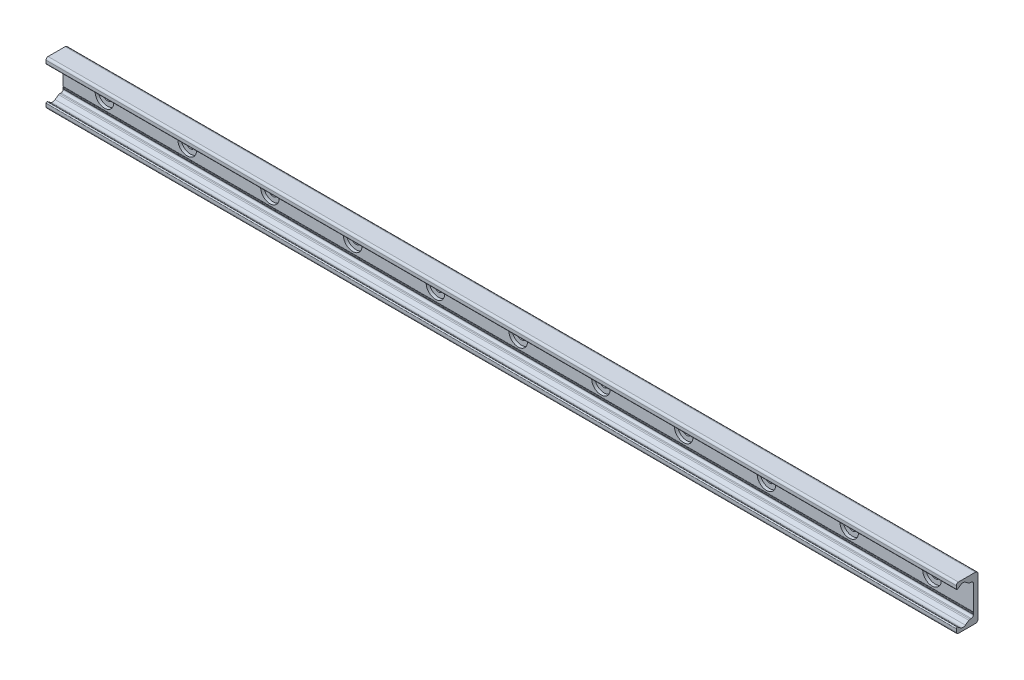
ISO-10303-21;
HEADER;
FILE_DESCRIPTION(('STEP AP214'),'2;1');
FILE_NAME('part.step','',(''),(''),'','','');
FILE_SCHEMA(('AUTOMOTIVE_DESIGN { 1 0 10303 214 1 1 1 1 }'));
ENDSEC;
DATA;
#1=APPLICATION_CONTEXT('core data for automotive mechanical design processes');
#2=APPLICATION_PROTOCOL_DEFINITION('international standard','automotive_design',2000,#1);
#3=PRODUCT_CONTEXT('',#1,'mechanical');
#4=PRODUCT('Part','Part','',(#3));
#5=PRODUCT_RELATED_PRODUCT_CATEGORY('part','',(#4));
#6=PRODUCT_DEFINITION_FORMATION('','',#4);
#7=PRODUCT_DEFINITION_CONTEXT('part definition',#1,'design');
#8=PRODUCT_DEFINITION('design','',#6,#7);
#9=PRODUCT_DEFINITION_SHAPE('','',#8);
#10=(LENGTH_UNIT() NAMED_UNIT(*) SI_UNIT(.MILLI.,.METRE.));
#11=(NAMED_UNIT(*) PLANE_ANGLE_UNIT() SI_UNIT($,.RADIAN.));
#12=(NAMED_UNIT(*) SI_UNIT($,.STERADIAN.) SOLID_ANGLE_UNIT());
#13=UNCERTAINTY_MEASURE_WITH_UNIT(LENGTH_MEASURE(1.E-05),#10,'distance_accuracy_value','');
#14=(GEOMETRIC_REPRESENTATION_CONTEXT(3) GLOBAL_UNCERTAINTY_ASSIGNED_CONTEXT((#13)) GLOBAL_UNIT_ASSIGNED_CONTEXT((#10,
#11,#12)) REPRESENTATION_CONTEXT('',''));
#15=CARTESIAN_POINT('',(0.,0.,0.));
#16=DIRECTION('',(0.,0.,1.));
#17=DIRECTION('',(1.,0.,0.));
#18=AXIS2_PLACEMENT_3D('',#15,#16,#17);
#19=CARTESIAN_POINT('',(-400.,0.,1.39999999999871));
#20=DIRECTION('',(0.,0.,1.));
#21=DIRECTION('',(1.,0.,0.));
#22=AXIS2_PLACEMENT_3D('',#19,#20,#21);
#23=PLANE('',#22);
#24=CARTESIAN_POINT('',(-400.,0.,1.39999999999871));
#25=DIRECTION('',(0.,0.,1.));
#26=DIRECTION('',(1.,0.,0.));
#27=AXIS2_PLACEMENT_3D('',#24,#25,#26);
#28=CIRCLE('',#27,4.50000000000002);
#29=CARTESIAN_POINT('',(-395.5,0.,1.39999999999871));
#30=VERTEX_POINT('',#29);
#31=EDGE_CURVE('E545',#30,#30,#28,.T.);
#32=ORIENTED_EDGE('',*,*,#31,.F.);
#33=EDGE_LOOP('',(#32));
#34=FACE_BOUND('',#33,.T.);
#35=CARTESIAN_POINT('',(-400.,0.,1.39999999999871));
#36=DIRECTION('',(0.,0.,1.));
#37=DIRECTION('',(1.,0.,0.));
#38=AXIS2_PLACEMENT_3D('',#35,#36,#37);
#39=CIRCLE('',#38,8.99999999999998);
#40=CARTESIAN_POINT('',(-391.,0.,1.39999999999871));
#41=VERTEX_POINT('',#40);
#42=EDGE_CURVE('E11',#41,#41,#39,.T.);
#43=ORIENTED_EDGE('',*,*,#42,.T.);
#44=EDGE_LOOP('',(#43));
#45=FACE_BOUND('',#44,.T.);
#46=ADVANCED_FACE('F39',(#34,#45),#23,.T.);
#47=CARTESIAN_POINT('',(-400.,0.,1.39999999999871));
#48=DIRECTION('',(0.,0.,1.));
#49=DIRECTION('',(1.,0.,0.));
#50=AXIS2_PLACEMENT_3D('',#47,#48,#49);
#51=CYLINDRICAL_SURFACE('',#50,8.99999999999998);
#52=CARTESIAN_POINT('',(-400.,0.,4.49999999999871));
#53=DIRECTION('',(0.,0.,1.));
#54=DIRECTION('',(1.,0.,0.));
#55=AXIS2_PLACEMENT_3D('',#52,#53,#54);
#56=CIRCLE('',#55,8.99999999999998);
#57=CARTESIAN_POINT('',(-391.,0.,4.49999999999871));
#58=VERTEX_POINT('',#57);
#59=EDGE_CURVE('E49',#58,#58,#56,.T.);
#60=CARTESIAN_POINT('',(-391.,0.,1.39999999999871));
#61=CARTESIAN_POINT('',(-391.,0.,1.43229166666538));
#62=CARTESIAN_POINT('',(-391.,0.,1.46458333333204));
#63=CARTESIAN_POINT('',(-391.,0.,1.52916666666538));
#64=CARTESIAN_POINT('',(-391.,0.,1.56145833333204));
#65=CARTESIAN_POINT('',(-391.,0.,1.62604166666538));
#66=CARTESIAN_POINT('',(-391.,0.,1.65833333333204));
#67=CARTESIAN_POINT('',(-391.,0.,1.72291666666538));
#68=CARTESIAN_POINT('',(-391.,0.,1.75520833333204));
#69=CARTESIAN_POINT('',(-391.,0.,1.81979166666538));
#70=CARTESIAN_POINT('',(-391.,0.,1.85208333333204));
#71=CARTESIAN_POINT('',(-391.,0.,1.91666666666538));
#72=CARTESIAN_POINT('',(-391.,0.,1.94895833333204));
#73=CARTESIAN_POINT('',(-391.,0.,2.01354166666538));
#74=CARTESIAN_POINT('',(-391.,0.,2.04583333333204));
#75=CARTESIAN_POINT('',(-391.,0.,2.11041666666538));
#76=CARTESIAN_POINT('',(-391.,0.,2.14270833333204));
#77=CARTESIAN_POINT('',(-391.,0.,2.20729166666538));
#78=CARTESIAN_POINT('',(-391.,0.,2.23958333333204));
#79=CARTESIAN_POINT('',(-391.,0.,2.30416666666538));
#80=CARTESIAN_POINT('',(-391.,0.,2.33645833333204));
#81=CARTESIAN_POINT('',(-391.,0.,2.40104166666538));
#82=CARTESIAN_POINT('',(-391.,0.,2.43333333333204));
#83=CARTESIAN_POINT('',(-391.,0.,2.49791666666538));
#84=CARTESIAN_POINT('',(-391.,0.,2.53020833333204));
#85=CARTESIAN_POINT('',(-391.,0.,2.59479166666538));
#86=CARTESIAN_POINT('',(-391.,0.,2.62708333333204));
#87=CARTESIAN_POINT('',(-391.,0.,2.69166666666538));
#88=CARTESIAN_POINT('',(-391.,0.,2.72395833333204));
#89=CARTESIAN_POINT('',(-391.,0.,2.78854166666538));
#90=CARTESIAN_POINT('',(-391.,0.,2.82083333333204));
#91=CARTESIAN_POINT('',(-391.,0.,2.88541666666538));
#92=CARTESIAN_POINT('',(-391.,0.,2.91770833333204));
#93=CARTESIAN_POINT('',(-391.,0.,2.98229166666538));
#94=CARTESIAN_POINT('',(-391.,0.,3.01458333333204));
#95=CARTESIAN_POINT('',(-391.,0.,3.07916666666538));
#96=CARTESIAN_POINT('',(-391.,0.,3.11145833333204));
#97=CARTESIAN_POINT('',(-391.,0.,3.17604166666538));
#98=CARTESIAN_POINT('',(-391.,0.,3.20833333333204));
#99=CARTESIAN_POINT('',(-391.,0.,3.27291666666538));
#100=CARTESIAN_POINT('',(-391.,0.,3.30520833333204));
#101=CARTESIAN_POINT('',(-391.,0.,3.36979166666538));
#102=CARTESIAN_POINT('',(-391.,0.,3.40208333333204));
#103=CARTESIAN_POINT('',(-391.,0.,3.46666666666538));
#104=CARTESIAN_POINT('',(-391.,0.,3.49895833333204));
#105=CARTESIAN_POINT('',(-391.,0.,3.56354166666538));
#106=CARTESIAN_POINT('',(-391.,0.,3.59583333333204));
#107=CARTESIAN_POINT('',(-391.,0.,3.66041666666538));
#108=CARTESIAN_POINT('',(-391.,0.,3.69270833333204));
#109=CARTESIAN_POINT('',(-391.,0.,3.75729166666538));
#110=CARTESIAN_POINT('',(-391.,0.,3.78958333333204));
#111=CARTESIAN_POINT('',(-391.,0.,3.85416666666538));
#112=CARTESIAN_POINT('',(-391.,0.,3.88645833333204));
#113=CARTESIAN_POINT('',(-391.,0.,3.95104166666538));
#114=CARTESIAN_POINT('',(-391.,0.,3.98333333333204));
#115=CARTESIAN_POINT('',(-391.,0.,4.04791666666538));
#116=CARTESIAN_POINT('',(-391.,0.,4.08020833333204));
#117=CARTESIAN_POINT('',(-391.,0.,4.14479166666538));
#118=CARTESIAN_POINT('',(-391.,0.,4.17708333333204));
#119=CARTESIAN_POINT('',(-391.,0.,4.24166666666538));
#120=CARTESIAN_POINT('',(-391.,0.,4.27395833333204));
#121=CARTESIAN_POINT('',(-391.,0.,4.33854166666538));
#122=CARTESIAN_POINT('',(-391.,0.,4.37083333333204));
#123=CARTESIAN_POINT('',(-391.,0.,4.43541666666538));
#124=CARTESIAN_POINT('',(-391.,0.,4.46770833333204));
#125=CARTESIAN_POINT('',(-391.,0.,4.49999999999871));
#126=B_SPLINE_CURVE_WITH_KNOTS('',3,(#60,#61,#62,#63,#64,#65,#66,#67,#68,#69,#70,#71,#72,#73,
#74,#75,#76,#77,#78,#79,#80,#81,#82,#83,#84,#85,#86,#87,#88,#89,#90,#91,#92,#93,#94,#95,#96,#97,
#98,#99,#100,#101,#102,#103,#104,#105,#106,#107,#108,#109,#110,#111,#112,#113,#114,#115,#116,
#117,#118,#119,#120,#121,#122,#123,#124,#125),.UNSPECIFIED.,.F.,.F.,(4,2,2,2,2,2,2,2,2,2,2,2,2,
2,2,2,2,2,2,2,2,2,2,2,2,2,2,2,2,2,2,2,4),(0.,0.0968750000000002,0.19375,0.290625,0.3875,
0.484375,0.58125,0.678125,0.775,0.871875,0.96875,1.065625,1.1625,1.259375,1.35625,1.453125,1.55,
1.646875,1.74375,1.840625,1.9375,2.034375,2.13125,2.228125,2.325,2.421875,2.51875,2.615625,
2.7125,2.809375,2.90625,3.003125,3.1),.UNSPECIFIED.);
#127=EDGE_CURVE('BSEAM515',#41,#58,#126,.T.);
#128=ORIENTED_EDGE('',*,*,#42,.F.);
#129=ORIENTED_EDGE('',*,*,#59,.T.);
#130=ORIENTED_EDGE('',*,*,#127,.T.);
#131=ORIENTED_EDGE('',*,*,#127,.F.);
#132=EDGE_LOOP('',(#128,#130,#129,#131));
#133=FACE_BOUND('',#132,.T.);
#134=ADVANCED_FACE('F515',(#133),#51,.F.);
#135=CARTESIAN_POINT('',(-320.,0.,1.39999999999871));
#136=DIRECTION('',(0.,0.,1.));
#137=DIRECTION('',(1.,0.,0.));
#138=AXIS2_PLACEMENT_3D('',#135,#136,#137);
#139=PLANE('',#138);
#140=CARTESIAN_POINT('',(-320.,0.,1.39999999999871));
#141=DIRECTION('',(0.,0.,1.));
#142=DIRECTION('',(1.,0.,0.));
#143=AXIS2_PLACEMENT_3D('',#140,#141,#142);
#144=CIRCLE('',#143,4.50000000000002);
#145=CARTESIAN_POINT('',(-315.5,0.,1.39999999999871));
#146=VERTEX_POINT('',#145);
#147=EDGE_CURVE('E549',#146,#146,#144,.T.);
#148=ORIENTED_EDGE('',*,*,#147,.F.);
#149=EDGE_LOOP('',(#148));
#150=FACE_BOUND('',#149,.T.);
#151=CARTESIAN_POINT('',(-320.,0.,1.39999999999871));
#152=DIRECTION('',(0.,0.,1.));
#153=DIRECTION('',(1.,0.,0.));
#154=AXIS2_PLACEMENT_3D('',#151,#152,#153);
#155=CIRCLE('',#154,8.99999999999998);
#156=CARTESIAN_POINT('',(-311.,0.,1.39999999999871));
#157=VERTEX_POINT('',#156);
#158=EDGE_CURVE('E506',#157,#157,#155,.T.);
#159=ORIENTED_EDGE('',*,*,#158,.T.);
#160=EDGE_LOOP('',(#159));
#161=FACE_BOUND('',#160,.T.);
#162=ADVANCED_FACE('F540',(#150,#161),#139,.T.);
#163=CARTESIAN_POINT('',(-320.,0.,1.39999999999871));
#164=DIRECTION('',(0.,0.,1.));
#165=DIRECTION('',(1.,0.,0.));
#166=AXIS2_PLACEMENT_3D('',#163,#164,#165);
#167=CYLINDRICAL_SURFACE('',#166,8.99999999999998);
#168=CARTESIAN_POINT('',(-320.,0.,4.49999999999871));
#169=DIRECTION('',(0.,0.,1.));
#170=DIRECTION('',(1.,0.,0.));
#171=AXIS2_PLACEMENT_3D('',#168,#169,#170);
#172=CIRCLE('',#171,8.99999999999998);
#173=CARTESIAN_POINT('',(-311.,0.,4.49999999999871));
#174=VERTEX_POINT('',#173);
#175=EDGE_CURVE('E502',#174,#174,#172,.T.);
#176=CARTESIAN_POINT('',(-311.,0.,1.39999999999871));
#177=CARTESIAN_POINT('',(-311.,0.,1.43229166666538));
#178=CARTESIAN_POINT('',(-311.,0.,1.46458333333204));
#179=CARTESIAN_POINT('',(-311.,0.,1.52916666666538));
#180=CARTESIAN_POINT('',(-311.,0.,1.56145833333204));
#181=CARTESIAN_POINT('',(-311.,0.,1.62604166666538));
#182=CARTESIAN_POINT('',(-311.,0.,1.65833333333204));
#183=CARTESIAN_POINT('',(-311.,0.,1.72291666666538));
#184=CARTESIAN_POINT('',(-311.,0.,1.75520833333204));
#185=CARTESIAN_POINT('',(-311.,0.,1.81979166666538));
#186=CARTESIAN_POINT('',(-311.,0.,1.85208333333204));
#187=CARTESIAN_POINT('',(-311.,0.,1.91666666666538));
#188=CARTESIAN_POINT('',(-311.,0.,1.94895833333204));
#189=CARTESIAN_POINT('',(-311.,0.,2.01354166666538));
#190=CARTESIAN_POINT('',(-311.,0.,2.04583333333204));
#191=CARTESIAN_POINT('',(-311.,0.,2.11041666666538));
#192=CARTESIAN_POINT('',(-311.,0.,2.14270833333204));
#193=CARTESIAN_POINT('',(-311.,0.,2.20729166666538));
#194=CARTESIAN_POINT('',(-311.,0.,2.23958333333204));
#195=CARTESIAN_POINT('',(-311.,0.,2.30416666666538));
#196=CARTESIAN_POINT('',(-311.,0.,2.33645833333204));
#197=CARTESIAN_POINT('',(-311.,0.,2.40104166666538));
#198=CARTESIAN_POINT('',(-311.,0.,2.43333333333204));
#199=CARTESIAN_POINT('',(-311.,0.,2.49791666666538));
#200=CARTESIAN_POINT('',(-311.,0.,2.53020833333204));
#201=CARTESIAN_POINT('',(-311.,0.,2.59479166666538));
#202=CARTESIAN_POINT('',(-311.,0.,2.62708333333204));
#203=CARTESIAN_POINT('',(-311.,0.,2.69166666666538));
#204=CARTESIAN_POINT('',(-311.,0.,2.72395833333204));
#205=CARTESIAN_POINT('',(-311.,0.,2.78854166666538));
#206=CARTESIAN_POINT('',(-311.,0.,2.82083333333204));
#207=CARTESIAN_POINT('',(-311.,0.,2.88541666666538));
#208=CARTESIAN_POINT('',(-311.,0.,2.91770833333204));
#209=CARTESIAN_POINT('',(-311.,0.,2.98229166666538));
#210=CARTESIAN_POINT('',(-311.,0.,3.01458333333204));
#211=CARTESIAN_POINT('',(-311.,0.,3.07916666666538));
#212=CARTESIAN_POINT('',(-311.,0.,3.11145833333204));
#213=CARTESIAN_POINT('',(-311.,0.,3.17604166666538));
#214=CARTESIAN_POINT('',(-311.,0.,3.20833333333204));
#215=CARTESIAN_POINT('',(-311.,0.,3.27291666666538));
#216=CARTESIAN_POINT('',(-311.,0.,3.30520833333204));
#217=CARTESIAN_POINT('',(-311.,0.,3.36979166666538));
#218=CARTESIAN_POINT('',(-311.,0.,3.40208333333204));
#219=CARTESIAN_POINT('',(-311.,0.,3.46666666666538));
#220=CARTESIAN_POINT('',(-311.,0.,3.49895833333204));
#221=CARTESIAN_POINT('',(-311.,0.,3.56354166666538));
#222=CARTESIAN_POINT('',(-311.,0.,3.59583333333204));
#223=CARTESIAN_POINT('',(-311.,0.,3.66041666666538));
#224=CARTESIAN_POINT('',(-311.,0.,3.69270833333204));
#225=CARTESIAN_POINT('',(-311.,0.,3.75729166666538));
#226=CARTESIAN_POINT('',(-311.,0.,3.78958333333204));
#227=CARTESIAN_POINT('',(-311.,0.,3.85416666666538));
#228=CARTESIAN_POINT('',(-311.,0.,3.88645833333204));
#229=CARTESIAN_POINT('',(-311.,0.,3.95104166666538));
#230=CARTESIAN_POINT('',(-311.,0.,3.98333333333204));
#231=CARTESIAN_POINT('',(-311.,0.,4.04791666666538));
#232=CARTESIAN_POINT('',(-311.,0.,4.08020833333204));
#233=CARTESIAN_POINT('',(-311.,0.,4.14479166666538));
#234=CARTESIAN_POINT('',(-311.,0.,4.17708333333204));
#235=CARTESIAN_POINT('',(-311.,0.,4.24166666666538));
#236=CARTESIAN_POINT('',(-311.,0.,4.27395833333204));
#237=CARTESIAN_POINT('',(-311.,0.,4.33854166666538));
#238=CARTESIAN_POINT('',(-311.,0.,4.37083333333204));
#239=CARTESIAN_POINT('',(-311.,0.,4.43541666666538));
#240=CARTESIAN_POINT('',(-311.,0.,4.46770833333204));
#241=CARTESIAN_POINT('',(-311.,0.,4.49999999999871));
#242=B_SPLINE_CURVE_WITH_KNOTS('',3,(#176,#177,#178,#179,#180,#181,#182,#183,#184,#185,#186,
#187,#188,#189,#190,#191,#192,#193,#194,#195,#196,#197,#198,#199,#200,#201,#202,#203,#204,#205,
#206,#207,#208,#209,#210,#211,#212,#213,#214,#215,#216,#217,#218,#219,#220,#221,#222,#223,#224,
#225,#226,#227,#228,#229,#230,#231,#232,#233,#234,#235,#236,#237,#238,#239,#240,#241),
.UNSPECIFIED.,.F.,.F.,(4,2,2,2,2,2,2,2,2,2,2,2,2,2,2,2,2,2,2,2,2,2,2,2,2,2,2,2,2,2,2,2,4),(0.,
0.0968750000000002,0.19375,0.290625,0.3875,0.484375,0.58125,0.678125,0.775,0.871875,0.96875,
1.065625,1.1625,1.259375,1.35625,1.453125,1.55,1.646875,1.74375,1.840625,1.9375,2.034375,
2.13125,2.228125,2.325,2.421875,2.51875,2.615625,2.7125,2.809375,2.90625,3.003125,3.1),.UNSPECIFIED.);
#243=EDGE_CURVE('BSEAM972',#157,#174,#242,.T.);
#244=ORIENTED_EDGE('',*,*,#158,.F.);
#245=ORIENTED_EDGE('',*,*,#175,.T.);
#246=ORIENTED_EDGE('',*,*,#243,.T.);
#247=ORIENTED_EDGE('',*,*,#243,.F.);
#248=EDGE_LOOP('',(#244,#246,#245,#247));
#249=FACE_BOUND('',#248,.T.);
#250=ADVANCED_FACE('F972',(#249),#167,.F.);
#251=CARTESIAN_POINT('',(-240.,0.,1.39999999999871));
#252=DIRECTION('',(0.,0.,1.));
#253=DIRECTION('',(1.,0.,0.));
#254=AXIS2_PLACEMENT_3D('',#251,#252,#253);
#255=PLANE('',#254);
#256=CARTESIAN_POINT('',(-240.,0.,1.39999999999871));
#257=DIRECTION('',(0.,0.,1.));
#258=DIRECTION('',(1.,0.,0.));
#259=AXIS2_PLACEMENT_3D('',#256,#257,#258);
#260=CIRCLE('',#259,4.50000000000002);
#261=CARTESIAN_POINT('',(-235.5,0.,1.39999999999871));
#262=VERTEX_POINT('',#261);
#263=EDGE_CURVE('E554',#262,#262,#260,.T.);
#264=ORIENTED_EDGE('',*,*,#263,.F.);
#265=EDGE_LOOP('',(#264));
#266=FACE_BOUND('',#265,.T.);
#267=CARTESIAN_POINT('',(-240.,0.,1.39999999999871));
#268=DIRECTION('',(0.,0.,1.));
#269=DIRECTION('',(1.,0.,0.));
#270=AXIS2_PLACEMENT_3D('',#267,#268,#269);
#271=CIRCLE('',#270,8.99999999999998);
#272=CARTESIAN_POINT('',(-231.,0.,1.39999999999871));
#273=VERTEX_POINT('',#272);
#274=EDGE_CURVE('E498',#273,#273,#271,.T.);
#275=ORIENTED_EDGE('',*,*,#274,.T.);
#276=EDGE_LOOP('',(#275));
#277=FACE_BOUND('',#276,.T.);
#278=ADVANCED_FACE('F968',(#266,#277),#255,.T.);
#279=CARTESIAN_POINT('',(-240.,0.,1.39999999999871));
#280=DIRECTION('',(0.,0.,1.));
#281=DIRECTION('',(1.,0.,0.));
#282=AXIS2_PLACEMENT_3D('',#279,#280,#281);
#283=CYLINDRICAL_SURFACE('',#282,8.99999999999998);
#284=CARTESIAN_POINT('',(-240.,0.,4.49999999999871));
#285=DIRECTION('',(0.,0.,1.));
#286=DIRECTION('',(1.,0.,0.));
#287=AXIS2_PLACEMENT_3D('',#284,#285,#286);
#288=CIRCLE('',#287,8.99999999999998);
#289=CARTESIAN_POINT('',(-231.,0.,4.49999999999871));
#290=VERTEX_POINT('',#289);
#291=EDGE_CURVE('E494',#290,#290,#288,.T.);
#292=CARTESIAN_POINT('',(-231.,0.,1.39999999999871));
#293=CARTESIAN_POINT('',(-231.,0.,1.43229166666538));
#294=CARTESIAN_POINT('',(-231.,0.,1.46458333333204));
#295=CARTESIAN_POINT('',(-231.,0.,1.52916666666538));
#296=CARTESIAN_POINT('',(-231.,0.,1.56145833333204));
#297=CARTESIAN_POINT('',(-231.,0.,1.62604166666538));
#298=CARTESIAN_POINT('',(-231.,0.,1.65833333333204));
#299=CARTESIAN_POINT('',(-231.,0.,1.72291666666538));
#300=CARTESIAN_POINT('',(-231.,0.,1.75520833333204));
#301=CARTESIAN_POINT('',(-231.,0.,1.81979166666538));
#302=CARTESIAN_POINT('',(-231.,0.,1.85208333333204));
#303=CARTESIAN_POINT('',(-231.,0.,1.91666666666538));
#304=CARTESIAN_POINT('',(-231.,0.,1.94895833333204));
#305=CARTESIAN_POINT('',(-231.,0.,2.01354166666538));
#306=CARTESIAN_POINT('',(-231.,0.,2.04583333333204));
#307=CARTESIAN_POINT('',(-231.,0.,2.11041666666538));
#308=CARTESIAN_POINT('',(-231.,0.,2.14270833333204));
#309=CARTESIAN_POINT('',(-231.,0.,2.20729166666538));
#310=CARTESIAN_POINT('',(-231.,0.,2.23958333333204));
#311=CARTESIAN_POINT('',(-231.,0.,2.30416666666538));
#312=CARTESIAN_POINT('',(-231.,0.,2.33645833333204));
#313=CARTESIAN_POINT('',(-231.,0.,2.40104166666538));
#314=CARTESIAN_POINT('',(-231.,0.,2.43333333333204));
#315=CARTESIAN_POINT('',(-231.,0.,2.49791666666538));
#316=CARTESIAN_POINT('',(-231.,0.,2.53020833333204));
#317=CARTESIAN_POINT('',(-231.,0.,2.59479166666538));
#318=CARTESIAN_POINT('',(-231.,0.,2.62708333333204));
#319=CARTESIAN_POINT('',(-231.,0.,2.69166666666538));
#320=CARTESIAN_POINT('',(-231.,0.,2.72395833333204));
#321=CARTESIAN_POINT('',(-231.,0.,2.78854166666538));
#322=CARTESIAN_POINT('',(-231.,0.,2.82083333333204));
#323=CARTESIAN_POINT('',(-231.,0.,2.88541666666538));
#324=CARTESIAN_POINT('',(-231.,0.,2.91770833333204));
#325=CARTESIAN_POINT('',(-231.,0.,2.98229166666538));
#326=CARTESIAN_POINT('',(-231.,0.,3.01458333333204));
#327=CARTESIAN_POINT('',(-231.,0.,3.07916666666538));
#328=CARTESIAN_POINT('',(-231.,0.,3.11145833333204));
#329=CARTESIAN_POINT('',(-231.,0.,3.17604166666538));
#330=CARTESIAN_POINT('',(-231.,0.,3.20833333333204));
#331=CARTESIAN_POINT('',(-231.,0.,3.27291666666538));
#332=CARTESIAN_POINT('',(-231.,0.,3.30520833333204));
#333=CARTESIAN_POINT('',(-231.,0.,3.36979166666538));
#334=CARTESIAN_POINT('',(-231.,0.,3.40208333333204));
#335=CARTESIAN_POINT('',(-231.,0.,3.46666666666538));
#336=CARTESIAN_POINT('',(-231.,0.,3.49895833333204));
#337=CARTESIAN_POINT('',(-231.,0.,3.56354166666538));
#338=CARTESIAN_POINT('',(-231.,0.,3.59583333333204));
#339=CARTESIAN_POINT('',(-231.,0.,3.66041666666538));
#340=CARTESIAN_POINT('',(-231.,0.,3.69270833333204));
#341=CARTESIAN_POINT('',(-231.,0.,3.75729166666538));
#342=CARTESIAN_POINT('',(-231.,0.,3.78958333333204));
#343=CARTESIAN_POINT('',(-231.,0.,3.85416666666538));
#344=CARTESIAN_POINT('',(-231.,0.,3.88645833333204));
#345=CARTESIAN_POINT('',(-231.,0.,3.95104166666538));
#346=CARTESIAN_POINT('',(-231.,0.,3.98333333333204));
#347=CARTESIAN_POINT('',(-231.,0.,4.04791666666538));
#348=CARTESIAN_POINT('',(-231.,0.,4.08020833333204));
#349=CARTESIAN_POINT('',(-231.,0.,4.14479166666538));
#350=CARTESIAN_POINT('',(-231.,0.,4.17708333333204));
#351=CARTESIAN_POINT('',(-231.,0.,4.24166666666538));
#352=CARTESIAN_POINT('',(-231.,0.,4.27395833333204));
#353=CARTESIAN_POINT('',(-231.,0.,4.33854166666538));
#354=CARTESIAN_POINT('',(-231.,0.,4.37083333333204));
#355=CARTESIAN_POINT('',(-231.,0.,4.43541666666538));
#356=CARTESIAN_POINT('',(-231.,0.,4.46770833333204));
#357=CARTESIAN_POINT('',(-231.,0.,4.49999999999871));
#358=B_SPLINE_CURVE_WITH_KNOTS('',3,(#292,#293,#294,#295,#296,#297,#298,#299,#300,#301,#302,
#303,#304,#305,#306,#307,#308,#309,#310,#311,#312,#313,#314,#315,#316,#317,#318,#319,#320,#321,
#322,#323,#324,#325,#326,#327,#328,#329,#330,#331,#332,#333,#334,#335,#336,#337,#338,#339,#340,
#341,#342,#343,#344,#345,#346,#347,#348,#349,#350,#351,#352,#353,#354,#355,#356,#357),
.UNSPECIFIED.,.F.,.F.,(4,2,2,2,2,2,2,2,2,2,2,2,2,2,2,2,2,2,2,2,2,2,2,2,2,2,2,2,2,2,2,2,4),(0.,
0.0968750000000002,0.19375,0.290625,0.3875,0.484375,0.58125,0.678125,0.775,0.871875,0.96875,
1.065625,1.1625,1.259375,1.35625,1.453125,1.55,1.646875,1.74375,1.840625,1.9375,2.034375,
2.13125,2.228125,2.325,2.421875,2.51875,2.615625,2.7125,2.809375,2.90625,3.003125,3.1),.UNSPECIFIED.);
#359=EDGE_CURVE('BSEAM964',#273,#290,#358,.T.);
#360=ORIENTED_EDGE('',*,*,#274,.F.);
#361=ORIENTED_EDGE('',*,*,#291,.T.);
#362=ORIENTED_EDGE('',*,*,#359,.T.);
#363=ORIENTED_EDGE('',*,*,#359,.F.);
#364=EDGE_LOOP('',(#360,#362,#361,#363));
#365=FACE_BOUND('',#364,.T.);
#366=ADVANCED_FACE('F964',(#365),#283,.F.);
#367=CARTESIAN_POINT('',(-160.,0.,1.39999999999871));
#368=DIRECTION('',(0.,0.,1.));
#369=DIRECTION('',(1.,0.,0.));
#370=AXIS2_PLACEMENT_3D('',#367,#368,#369);
#371=PLANE('',#370);
#372=CARTESIAN_POINT('',(-160.,0.,1.39999999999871));
#373=DIRECTION('',(0.,0.,1.));
#374=DIRECTION('',(1.,0.,0.));
#375=AXIS2_PLACEMENT_3D('',#372,#373,#374);
#376=CIRCLE('',#375,4.50000000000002);
#377=CARTESIAN_POINT('',(-155.5,0.,1.39999999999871));
#378=VERTEX_POINT('',#377);
#379=EDGE_CURVE('E566',#378,#378,#376,.T.);
#380=ORIENTED_EDGE('',*,*,#379,.F.);
#381=EDGE_LOOP('',(#380));
#382=FACE_BOUND('',#381,.T.);
#383=CARTESIAN_POINT('',(-160.,0.,1.39999999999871));
#384=DIRECTION('',(0.,0.,1.));
#385=DIRECTION('',(1.,0.,0.));
#386=AXIS2_PLACEMENT_3D('',#383,#384,#385);
#387=CIRCLE('',#386,8.99999999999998);
#388=CARTESIAN_POINT('',(-151.,0.,1.39999999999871));
#389=VERTEX_POINT('',#388);
#390=EDGE_CURVE('E490',#389,#389,#387,.T.);
#391=ORIENTED_EDGE('',*,*,#390,.T.);
#392=EDGE_LOOP('',(#391));
#393=FACE_BOUND('',#392,.T.);
#394=ADVANCED_FACE('F960',(#382,#393),#371,.T.);
#395=CARTESIAN_POINT('',(-160.,0.,1.39999999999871));
#396=DIRECTION('',(0.,0.,1.));
#397=DIRECTION('',(1.,0.,0.));
#398=AXIS2_PLACEMENT_3D('',#395,#396,#397);
#399=CYLINDRICAL_SURFACE('',#398,8.99999999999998);
#400=CARTESIAN_POINT('',(-160.,0.,4.49999999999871));
#401=DIRECTION('',(0.,0.,1.));
#402=DIRECTION('',(1.,0.,0.));
#403=AXIS2_PLACEMENT_3D('',#400,#401,#402);
#404=CIRCLE('',#403,8.99999999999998);
#405=CARTESIAN_POINT('',(-151.,0.,4.49999999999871));
#406=VERTEX_POINT('',#405);
#407=EDGE_CURVE('E486',#406,#406,#404,.T.);
#408=CARTESIAN_POINT('',(-151.,0.,1.39999999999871));
#409=CARTESIAN_POINT('',(-151.,0.,1.43229166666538));
#410=CARTESIAN_POINT('',(-151.,0.,1.46458333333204));
#411=CARTESIAN_POINT('',(-151.,0.,1.52916666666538));
#412=CARTESIAN_POINT('',(-151.,0.,1.56145833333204));
#413=CARTESIAN_POINT('',(-151.,0.,1.62604166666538));
#414=CARTESIAN_POINT('',(-151.,0.,1.65833333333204));
#415=CARTESIAN_POINT('',(-151.,0.,1.72291666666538));
#416=CARTESIAN_POINT('',(-151.,0.,1.75520833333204));
#417=CARTESIAN_POINT('',(-151.,0.,1.81979166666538));
#418=CARTESIAN_POINT('',(-151.,0.,1.85208333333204));
#419=CARTESIAN_POINT('',(-151.,0.,1.91666666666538));
#420=CARTESIAN_POINT('',(-151.,0.,1.94895833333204));
#421=CARTESIAN_POINT('',(-151.,0.,2.01354166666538));
#422=CARTESIAN_POINT('',(-151.,0.,2.04583333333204));
#423=CARTESIAN_POINT('',(-151.,0.,2.11041666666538));
#424=CARTESIAN_POINT('',(-151.,0.,2.14270833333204));
#425=CARTESIAN_POINT('',(-151.,0.,2.20729166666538));
#426=CARTESIAN_POINT('',(-151.,0.,2.23958333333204));
#427=CARTESIAN_POINT('',(-151.,0.,2.30416666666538));
#428=CARTESIAN_POINT('',(-151.,0.,2.33645833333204));
#429=CARTESIAN_POINT('',(-151.,0.,2.40104166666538));
#430=CARTESIAN_POINT('',(-151.,0.,2.43333333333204));
#431=CARTESIAN_POINT('',(-151.,0.,2.49791666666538));
#432=CARTESIAN_POINT('',(-151.,0.,2.53020833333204));
#433=CARTESIAN_POINT('',(-151.,0.,2.59479166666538));
#434=CARTESIAN_POINT('',(-151.,0.,2.62708333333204));
#435=CARTESIAN_POINT('',(-151.,0.,2.69166666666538));
#436=CARTESIAN_POINT('',(-151.,0.,2.72395833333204));
#437=CARTESIAN_POINT('',(-151.,0.,2.78854166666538));
#438=CARTESIAN_POINT('',(-151.,0.,2.82083333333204));
#439=CARTESIAN_POINT('',(-151.,0.,2.88541666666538));
#440=CARTESIAN_POINT('',(-151.,0.,2.91770833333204));
#441=CARTESIAN_POINT('',(-151.,0.,2.98229166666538));
#442=CARTESIAN_POINT('',(-151.,0.,3.01458333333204));
#443=CARTESIAN_POINT('',(-151.,0.,3.07916666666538));
#444=CARTESIAN_POINT('',(-151.,0.,3.11145833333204));
#445=CARTESIAN_POINT('',(-151.,0.,3.17604166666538));
#446=CARTESIAN_POINT('',(-151.,0.,3.20833333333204));
#447=CARTESIAN_POINT('',(-151.,0.,3.27291666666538));
#448=CARTESIAN_POINT('',(-151.,0.,3.30520833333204));
#449=CARTESIAN_POINT('',(-151.,0.,3.36979166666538));
#450=CARTESIAN_POINT('',(-151.,0.,3.40208333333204));
#451=CARTESIAN_POINT('',(-151.,0.,3.46666666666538));
#452=CARTESIAN_POINT('',(-151.,0.,3.49895833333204));
#453=CARTESIAN_POINT('',(-151.,0.,3.56354166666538));
#454=CARTESIAN_POINT('',(-151.,0.,3.59583333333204));
#455=CARTESIAN_POINT('',(-151.,0.,3.66041666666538));
#456=CARTESIAN_POINT('',(-151.,0.,3.69270833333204));
#457=CARTESIAN_POINT('',(-151.,0.,3.75729166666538));
#458=CARTESIAN_POINT('',(-151.,0.,3.78958333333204));
#459=CARTESIAN_POINT('',(-151.,0.,3.85416666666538));
#460=CARTESIAN_POINT('',(-151.,0.,3.88645833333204));
#461=CARTESIAN_POINT('',(-151.,0.,3.95104166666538));
#462=CARTESIAN_POINT('',(-151.,0.,3.98333333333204));
#463=CARTESIAN_POINT('',(-151.,0.,4.04791666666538));
#464=CARTESIAN_POINT('',(-151.,0.,4.08020833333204));
#465=CARTESIAN_POINT('',(-151.,0.,4.14479166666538));
#466=CARTESIAN_POINT('',(-151.,0.,4.17708333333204));
#467=CARTESIAN_POINT('',(-151.,0.,4.24166666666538));
#468=CARTESIAN_POINT('',(-151.,0.,4.27395833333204));
#469=CARTESIAN_POINT('',(-151.,0.,4.33854166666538));
#470=CARTESIAN_POINT('',(-151.,0.,4.37083333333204));
#471=CARTESIAN_POINT('',(-151.,0.,4.43541666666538));
#472=CARTESIAN_POINT('',(-151.,0.,4.46770833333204));
#473=CARTESIAN_POINT('',(-151.,0.,4.49999999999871));
#474=B_SPLINE_CURVE_WITH_KNOTS('',3,(#408,#409,#410,#411,#412,#413,#414,#415,#416,#417,#418,
#419,#420,#421,#422,#423,#424,#425,#426,#427,#428,#429,#430,#431,#432,#433,#434,#435,#436,#437,
#438,#439,#440,#441,#442,#443,#444,#445,#446,#447,#448,#449,#450,#451,#452,#453,#454,#455,#456,
#457,#458,#459,#460,#461,#462,#463,#464,#465,#466,#467,#468,#469,#470,#471,#472,#473),
.UNSPECIFIED.,.F.,.F.,(4,2,2,2,2,2,2,2,2,2,2,2,2,2,2,2,2,2,2,2,2,2,2,2,2,2,2,2,2,2,2,2,4),(0.,
0.0968750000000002,0.19375,0.290625,0.3875,0.484375,0.58125,0.678125,0.775,0.871875,0.96875,
1.065625,1.1625,1.259375,1.35625,1.453125,1.55,1.646875,1.74375,1.840625,1.9375,2.034375,
2.13125,2.228125,2.325,2.421875,2.51875,2.615625,2.7125,2.809375,2.90625,3.003125,3.1),.UNSPECIFIED.);
#475=EDGE_CURVE('BSEAM956',#389,#406,#474,.T.);
#476=ORIENTED_EDGE('',*,*,#390,.F.);
#477=ORIENTED_EDGE('',*,*,#407,.T.);
#478=ORIENTED_EDGE('',*,*,#475,.T.);
#479=ORIENTED_EDGE('',*,*,#475,.F.);
#480=EDGE_LOOP('',(#476,#478,#477,#479));
#481=FACE_BOUND('',#480,.T.);
#482=ADVANCED_FACE('F956',(#481),#399,.F.);
#483=CARTESIAN_POINT('',(-80.,0.,1.39999999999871));
#484=DIRECTION('',(0.,0.,1.));
#485=DIRECTION('',(1.,0.,0.));
#486=AXIS2_PLACEMENT_3D('',#483,#484,#485);
#487=PLANE('',#486);
#488=CARTESIAN_POINT('',(-80.,0.,1.39999999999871));
#489=DIRECTION('',(0.,0.,1.));
#490=DIRECTION('',(1.,0.,0.));
#491=AXIS2_PLACEMENT_3D('',#488,#489,#490);
#492=CIRCLE('',#491,4.50000000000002);
#493=CARTESIAN_POINT('',(-75.4999999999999,0.,1.39999999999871));
#494=VERTEX_POINT('',#493);
#495=EDGE_CURVE('E570',#494,#494,#492,.T.);
#496=ORIENTED_EDGE('',*,*,#495,.F.);
#497=EDGE_LOOP('',(#496));
#498=FACE_BOUND('',#497,.T.);
#499=CARTESIAN_POINT('',(-80.,0.,1.39999999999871));
#500=DIRECTION('',(0.,0.,1.));
#501=DIRECTION('',(1.,0.,0.));
#502=AXIS2_PLACEMENT_3D('',#499,#500,#501);
#503=CIRCLE('',#502,8.99999999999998);
#504=CARTESIAN_POINT('',(-71.,0.,1.39999999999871));
#505=VERTEX_POINT('',#504);
#506=EDGE_CURVE('E482',#505,#505,#503,.T.);
#507=ORIENTED_EDGE('',*,*,#506,.T.);
#508=EDGE_LOOP('',(#507));
#509=FACE_BOUND('',#508,.T.);
#510=ADVANCED_FACE('F952',(#498,#509),#487,.T.);
#511=CARTESIAN_POINT('',(-80.,0.,1.39999999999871));
#512=DIRECTION('',(0.,0.,1.));
#513=DIRECTION('',(1.,0.,0.));
#514=AXIS2_PLACEMENT_3D('',#511,#512,#513);
#515=CYLINDRICAL_SURFACE('',#514,8.99999999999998);
#516=CARTESIAN_POINT('',(-80.,0.,4.49999999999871));
#517=DIRECTION('',(0.,0.,1.));
#518=DIRECTION('',(1.,0.,0.));
#519=AXIS2_PLACEMENT_3D('',#516,#517,#518);
#520=CIRCLE('',#519,8.99999999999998);
#521=CARTESIAN_POINT('',(-71.,0.,4.49999999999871));
#522=VERTEX_POINT('',#521);
#523=EDGE_CURVE('E478',#522,#522,#520,.T.);
#524=CARTESIAN_POINT('',(-71.,0.,1.39999999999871));
#525=CARTESIAN_POINT('',(-71.,0.,1.43229166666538));
#526=CARTESIAN_POINT('',(-71.,0.,1.46458333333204));
#527=CARTESIAN_POINT('',(-71.,0.,1.52916666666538));
#528=CARTESIAN_POINT('',(-71.,0.,1.56145833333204));
#529=CARTESIAN_POINT('',(-71.,0.,1.62604166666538));
#530=CARTESIAN_POINT('',(-71.,0.,1.65833333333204));
#531=CARTESIAN_POINT('',(-71.,0.,1.72291666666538));
#532=CARTESIAN_POINT('',(-71.,0.,1.75520833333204));
#533=CARTESIAN_POINT('',(-71.,0.,1.81979166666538));
#534=CARTESIAN_POINT('',(-71.,0.,1.85208333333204));
#535=CARTESIAN_POINT('',(-71.,0.,1.91666666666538));
#536=CARTESIAN_POINT('',(-71.,0.,1.94895833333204));
#537=CARTESIAN_POINT('',(-71.,0.,2.01354166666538));
#538=CARTESIAN_POINT('',(-71.,0.,2.04583333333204));
#539=CARTESIAN_POINT('',(-71.,0.,2.11041666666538));
#540=CARTESIAN_POINT('',(-71.,0.,2.14270833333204));
#541=CARTESIAN_POINT('',(-71.,0.,2.20729166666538));
#542=CARTESIAN_POINT('',(-71.,0.,2.23958333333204));
#543=CARTESIAN_POINT('',(-71.,0.,2.30416666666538));
#544=CARTESIAN_POINT('',(-71.,0.,2.33645833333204));
#545=CARTESIAN_POINT('',(-71.,0.,2.40104166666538));
#546=CARTESIAN_POINT('',(-71.,0.,2.43333333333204));
#547=CARTESIAN_POINT('',(-71.,0.,2.49791666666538));
#548=CARTESIAN_POINT('',(-71.,0.,2.53020833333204));
#549=CARTESIAN_POINT('',(-71.,0.,2.59479166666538));
#550=CARTESIAN_POINT('',(-71.,0.,2.62708333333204));
#551=CARTESIAN_POINT('',(-71.,0.,2.69166666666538));
#552=CARTESIAN_POINT('',(-71.,0.,2.72395833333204));
#553=CARTESIAN_POINT('',(-71.,0.,2.78854166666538));
#554=CARTESIAN_POINT('',(-71.,0.,2.82083333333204));
#555=CARTESIAN_POINT('',(-71.,0.,2.88541666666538));
#556=CARTESIAN_POINT('',(-71.,0.,2.91770833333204));
#557=CARTESIAN_POINT('',(-71.,0.,2.98229166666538));
#558=CARTESIAN_POINT('',(-71.,0.,3.01458333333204));
#559=CARTESIAN_POINT('',(-71.,0.,3.07916666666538));
#560=CARTESIAN_POINT('',(-71.,0.,3.11145833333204));
#561=CARTESIAN_POINT('',(-71.,0.,3.17604166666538));
#562=CARTESIAN_POINT('',(-71.,0.,3.20833333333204));
#563=CARTESIAN_POINT('',(-71.,0.,3.27291666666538));
#564=CARTESIAN_POINT('',(-71.,0.,3.30520833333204));
#565=CARTESIAN_POINT('',(-71.,0.,3.36979166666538));
#566=CARTESIAN_POINT('',(-71.,0.,3.40208333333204));
#567=CARTESIAN_POINT('',(-71.,0.,3.46666666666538));
#568=CARTESIAN_POINT('',(-71.,0.,3.49895833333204));
#569=CARTESIAN_POINT('',(-71.,0.,3.56354166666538));
#570=CARTESIAN_POINT('',(-71.,0.,3.59583333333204));
#571=CARTESIAN_POINT('',(-71.,0.,3.66041666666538));
#572=CARTESIAN_POINT('',(-71.,0.,3.69270833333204));
#573=CARTESIAN_POINT('',(-71.,0.,3.75729166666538));
#574=CARTESIAN_POINT('',(-71.,0.,3.78958333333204));
#575=CARTESIAN_POINT('',(-71.,0.,3.85416666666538));
#576=CARTESIAN_POINT('',(-71.,0.,3.88645833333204));
#577=CARTESIAN_POINT('',(-71.,0.,3.95104166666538));
#578=CARTESIAN_POINT('',(-71.,0.,3.98333333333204));
#579=CARTESIAN_POINT('',(-71.,0.,4.04791666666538));
#580=CARTESIAN_POINT('',(-71.,0.,4.08020833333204));
#581=CARTESIAN_POINT('',(-71.,0.,4.14479166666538));
#582=CARTESIAN_POINT('',(-71.,0.,4.17708333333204));
#583=CARTESIAN_POINT('',(-71.,0.,4.24166666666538));
#584=CARTESIAN_POINT('',(-71.,0.,4.27395833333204));
#585=CARTESIAN_POINT('',(-71.,0.,4.33854166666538));
#586=CARTESIAN_POINT('',(-71.,0.,4.37083333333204));
#587=CARTESIAN_POINT('',(-71.,0.,4.43541666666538));
#588=CARTESIAN_POINT('',(-71.,0.,4.46770833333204));
#589=CARTESIAN_POINT('',(-71.,0.,4.49999999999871));
#590=B_SPLINE_CURVE_WITH_KNOTS('',3,(#524,#525,#526,#527,#528,#529,#530,#531,#532,#533,#534,
#535,#536,#537,#538,#539,#540,#541,#542,#543,#544,#545,#546,#547,#548,#549,#550,#551,#552,#553,
#554,#555,#556,#557,#558,#559,#560,#561,#562,#563,#564,#565,#566,#567,#568,#569,#570,#571,#572,
#573,#574,#575,#576,#577,#578,#579,#580,#581,#582,#583,#584,#585,#586,#587,#588,#589),
.UNSPECIFIED.,.F.,.F.,(4,2,2,2,2,2,2,2,2,2,2,2,2,2,2,2,2,2,2,2,2,2,2,2,2,2,2,2,2,2,2,2,4),(0.,
0.0968750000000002,0.19375,0.290625,0.3875,0.484375,0.58125,0.678125,0.775,0.871875,0.96875,
1.065625,1.1625,1.259375,1.35625,1.453125,1.55,1.646875,1.74375,1.840625,1.9375,2.034375,
2.13125,2.228125,2.325,2.421875,2.51875,2.615625,2.7125,2.809375,2.90625,3.003125,3.1),.UNSPECIFIED.);
#591=EDGE_CURVE('BSEAM948',#505,#522,#590,.T.);
#592=ORIENTED_EDGE('',*,*,#506,.F.);
#593=ORIENTED_EDGE('',*,*,#523,.T.);
#594=ORIENTED_EDGE('',*,*,#591,.T.);
#595=ORIENTED_EDGE('',*,*,#591,.F.);
#596=EDGE_LOOP('',(#592,#594,#593,#595));
#597=FACE_BOUND('',#596,.T.);
#598=ADVANCED_FACE('F948',(#597),#515,.F.);
#599=CARTESIAN_POINT('',(0.,0.,1.39999999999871));
#600=DIRECTION('',(0.,0.,1.));
#601=DIRECTION('',(1.,0.,0.));
#602=AXIS2_PLACEMENT_3D('',#599,#600,#601);
#603=PLANE('',#602);
#604=CARTESIAN_POINT('',(0.,0.,1.39999999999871));
#605=DIRECTION('',(0.,0.,1.));
#606=DIRECTION('',(1.,0.,0.));
#607=AXIS2_PLACEMENT_3D('',#604,#605,#606);
#608=CIRCLE('',#607,4.50000000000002);
#609=CARTESIAN_POINT('',(4.50000000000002,0.,1.39999999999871));
#610=VERTEX_POINT('',#609);
#611=EDGE_CURVE('E574',#610,#610,#608,.T.);
#612=ORIENTED_EDGE('',*,*,#611,.F.);
#613=EDGE_LOOP('',(#612));
#614=FACE_BOUND('',#613,.T.);
#615=CARTESIAN_POINT('',(0.,0.,1.39999999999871));
#616=DIRECTION('',(0.,0.,1.));
#617=DIRECTION('',(1.,0.,0.));
#618=AXIS2_PLACEMENT_3D('',#615,#616,#617);
#619=CIRCLE('',#618,8.99999999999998);
#620=CARTESIAN_POINT('',(8.99999999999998,0.,1.39999999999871));
#621=VERTEX_POINT('',#620);
#622=EDGE_CURVE('E474',#621,#621,#619,.T.);
#623=ORIENTED_EDGE('',*,*,#622,.T.);
#624=EDGE_LOOP('',(#623));
#625=FACE_BOUND('',#624,.T.);
#626=ADVANCED_FACE('F944',(#614,#625),#603,.T.);
#627=CARTESIAN_POINT('',(0.,0.,1.39999999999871));
#628=DIRECTION('',(0.,0.,1.));
#629=DIRECTION('',(1.,0.,0.));
#630=AXIS2_PLACEMENT_3D('',#627,#628,#629);
#631=CYLINDRICAL_SURFACE('',#630,8.99999999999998);
#632=CARTESIAN_POINT('',(0.,0.,4.49999999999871));
#633=DIRECTION('',(0.,0.,1.));
#634=DIRECTION('',(1.,0.,0.));
#635=AXIS2_PLACEMENT_3D('',#632,#633,#634);
#636=CIRCLE('',#635,8.99999999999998);
#637=CARTESIAN_POINT('',(8.99999999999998,0.,4.49999999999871));
#638=VERTEX_POINT('',#637);
#639=EDGE_CURVE('E470',#638,#638,#636,.T.);
#640=CARTESIAN_POINT('',(8.99999999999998,0.,1.39999999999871));
#641=CARTESIAN_POINT('',(8.99999999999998,0.,1.43229166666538));
#642=CARTESIAN_POINT('',(8.99999999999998,0.,1.46458333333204));
#643=CARTESIAN_POINT('',(8.99999999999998,0.,1.52916666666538));
#644=CARTESIAN_POINT('',(8.99999999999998,0.,1.56145833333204));
#645=CARTESIAN_POINT('',(8.99999999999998,0.,1.62604166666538));
#646=CARTESIAN_POINT('',(8.99999999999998,0.,1.65833333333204));
#647=CARTESIAN_POINT('',(8.99999999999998,0.,1.72291666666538));
#648=CARTESIAN_POINT('',(8.99999999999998,0.,1.75520833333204));
#649=CARTESIAN_POINT('',(8.99999999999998,0.,1.81979166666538));
#650=CARTESIAN_POINT('',(8.99999999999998,0.,1.85208333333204));
#651=CARTESIAN_POINT('',(8.99999999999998,0.,1.91666666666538));
#652=CARTESIAN_POINT('',(8.99999999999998,0.,1.94895833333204));
#653=CARTESIAN_POINT('',(8.99999999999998,0.,2.01354166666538));
#654=CARTESIAN_POINT('',(8.99999999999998,0.,2.04583333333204));
#655=CARTESIAN_POINT('',(8.99999999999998,0.,2.11041666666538));
#656=CARTESIAN_POINT('',(8.99999999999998,0.,2.14270833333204));
#657=CARTESIAN_POINT('',(8.99999999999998,0.,2.20729166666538));
#658=CARTESIAN_POINT('',(8.99999999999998,0.,2.23958333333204));
#659=CARTESIAN_POINT('',(8.99999999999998,0.,2.30416666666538));
#660=CARTESIAN_POINT('',(8.99999999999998,0.,2.33645833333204));
#661=CARTESIAN_POINT('',(8.99999999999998,0.,2.40104166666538));
#662=CARTESIAN_POINT('',(8.99999999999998,0.,2.43333333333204));
#663=CARTESIAN_POINT('',(8.99999999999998,0.,2.49791666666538));
#664=CARTESIAN_POINT('',(8.99999999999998,0.,2.53020833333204));
#665=CARTESIAN_POINT('',(8.99999999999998,0.,2.59479166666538));
#666=CARTESIAN_POINT('',(8.99999999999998,0.,2.62708333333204));
#667=CARTESIAN_POINT('',(8.99999999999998,0.,2.69166666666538));
#668=CARTESIAN_POINT('',(8.99999999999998,0.,2.72395833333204));
#669=CARTESIAN_POINT('',(8.99999999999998,0.,2.78854166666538));
#670=CARTESIAN_POINT('',(8.99999999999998,0.,2.82083333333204));
#671=CARTESIAN_POINT('',(8.99999999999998,0.,2.88541666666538));
#672=CARTESIAN_POINT('',(8.99999999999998,0.,2.91770833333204));
#673=CARTESIAN_POINT('',(8.99999999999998,0.,2.98229166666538));
#674=CARTESIAN_POINT('',(8.99999999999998,0.,3.01458333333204));
#675=CARTESIAN_POINT('',(8.99999999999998,0.,3.07916666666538));
#676=CARTESIAN_POINT('',(8.99999999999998,0.,3.11145833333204));
#677=CARTESIAN_POINT('',(8.99999999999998,0.,3.17604166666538));
#678=CARTESIAN_POINT('',(8.99999999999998,0.,3.20833333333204));
#679=CARTESIAN_POINT('',(8.99999999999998,0.,3.27291666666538));
#680=CARTESIAN_POINT('',(8.99999999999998,0.,3.30520833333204));
#681=CARTESIAN_POINT('',(8.99999999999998,0.,3.36979166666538));
#682=CARTESIAN_POINT('',(8.99999999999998,0.,3.40208333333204));
#683=CARTESIAN_POINT('',(8.99999999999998,0.,3.46666666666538));
#684=CARTESIAN_POINT('',(8.99999999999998,0.,3.49895833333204));
#685=CARTESIAN_POINT('',(8.99999999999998,0.,3.56354166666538));
#686=CARTESIAN_POINT('',(8.99999999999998,0.,3.59583333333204));
#687=CARTESIAN_POINT('',(8.99999999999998,0.,3.66041666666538));
#688=CARTESIAN_POINT('',(8.99999999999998,0.,3.69270833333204));
#689=CARTESIAN_POINT('',(8.99999999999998,0.,3.75729166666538));
#690=CARTESIAN_POINT('',(8.99999999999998,0.,3.78958333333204));
#691=CARTESIAN_POINT('',(8.99999999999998,0.,3.85416666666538));
#692=CARTESIAN_POINT('',(8.99999999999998,0.,3.88645833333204));
#693=CARTESIAN_POINT('',(8.99999999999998,0.,3.95104166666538));
#694=CARTESIAN_POINT('',(8.99999999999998,0.,3.98333333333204));
#695=CARTESIAN_POINT('',(8.99999999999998,0.,4.04791666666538));
#696=CARTESIAN_POINT('',(8.99999999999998,0.,4.08020833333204));
#697=CARTESIAN_POINT('',(8.99999999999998,0.,4.14479166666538));
#698=CARTESIAN_POINT('',(8.99999999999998,0.,4.17708333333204));
#699=CARTESIAN_POINT('',(8.99999999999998,0.,4.24166666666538));
#700=CARTESIAN_POINT('',(8.99999999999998,0.,4.27395833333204));
#701=CARTESIAN_POINT('',(8.99999999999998,0.,4.33854166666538));
#702=CARTESIAN_POINT('',(8.99999999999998,0.,4.37083333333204));
#703=CARTESIAN_POINT('',(8.99999999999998,0.,4.43541666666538));
#704=CARTESIAN_POINT('',(8.99999999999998,0.,4.46770833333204));
#705=CARTESIAN_POINT('',(8.99999999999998,0.,4.49999999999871));
#706=B_SPLINE_CURVE_WITH_KNOTS('',3,(#640,#641,#642,#643,#644,#645,#646,#647,#648,#649,#650,
#651,#652,#653,#654,#655,#656,#657,#658,#659,#660,#661,#662,#663,#664,#665,#666,#667,#668,#669,
#670,#671,#672,#673,#674,#675,#676,#677,#678,#679,#680,#681,#682,#683,#684,#685,#686,#687,#688,
#689,#690,#691,#692,#693,#694,#695,#696,#697,#698,#699,#700,#701,#702,#703,#704,#705),
.UNSPECIFIED.,.F.,.F.,(4,2,2,2,2,2,2,2,2,2,2,2,2,2,2,2,2,2,2,2,2,2,2,2,2,2,2,2,2,2,2,2,4),(0.,
0.0968750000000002,0.19375,0.290625,0.3875,0.484375,0.58125,0.678125,0.775,0.871875,0.96875,
1.065625,1.1625,1.259375,1.35625,1.453125,1.55,1.646875,1.74375,1.840625,1.9375,2.034375,
2.13125,2.228125,2.325,2.421875,2.51875,2.615625,2.7125,2.809375,2.90625,3.003125,3.1),.UNSPECIFIED.);
#707=EDGE_CURVE('BSEAM940',#621,#638,#706,.T.);
#708=ORIENTED_EDGE('',*,*,#622,.F.);
#709=ORIENTED_EDGE('',*,*,#639,.T.);
#710=ORIENTED_EDGE('',*,*,#707,.T.);
#711=ORIENTED_EDGE('',*,*,#707,.F.);
#712=EDGE_LOOP('',(#708,#710,#709,#711));
#713=FACE_BOUND('',#712,.T.);
#714=ADVANCED_FACE('F940',(#713),#631,.F.);
#715=CARTESIAN_POINT('',(80.,0.,1.39999999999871));
#716=DIRECTION('',(0.,0.,1.));
#717=DIRECTION('',(1.,0.,0.));
#718=AXIS2_PLACEMENT_3D('',#715,#716,#717);
#719=PLANE('',#718);
#720=CARTESIAN_POINT('',(80.,0.,1.39999999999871));
#721=DIRECTION('',(0.,0.,1.));
#722=DIRECTION('',(1.,0.,0.));
#723=AXIS2_PLACEMENT_3D('',#720,#721,#722);
#724=CIRCLE('',#723,4.50000000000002);
#725=CARTESIAN_POINT('',(84.5,0.,1.39999999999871));
#726=VERTEX_POINT('',#725);
#727=EDGE_CURVE('E578',#726,#726,#724,.T.);
#728=ORIENTED_EDGE('',*,*,#727,.F.);
#729=EDGE_LOOP('',(#728));
#730=FACE_BOUND('',#729,.T.);
#731=CARTESIAN_POINT('',(80.,0.,1.39999999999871));
#732=DIRECTION('',(0.,0.,1.));
#733=DIRECTION('',(1.,0.,0.));
#734=AXIS2_PLACEMENT_3D('',#731,#732,#733);
#735=CIRCLE('',#734,8.99999999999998);
#736=CARTESIAN_POINT('',(89.,0.,1.39999999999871));
#737=VERTEX_POINT('',#736);
#738=EDGE_CURVE('E466',#737,#737,#735,.T.);
#739=ORIENTED_EDGE('',*,*,#738,.T.);
#740=EDGE_LOOP('',(#739));
#741=FACE_BOUND('',#740,.T.);
#742=ADVANCED_FACE('F936',(#730,#741),#719,.T.);
#743=CARTESIAN_POINT('',(80.,0.,1.39999999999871));
#744=DIRECTION('',(0.,0.,1.));
#745=DIRECTION('',(1.,0.,0.));
#746=AXIS2_PLACEMENT_3D('',#743,#744,#745);
#747=CYLINDRICAL_SURFACE('',#746,8.99999999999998);
#748=CARTESIAN_POINT('',(80.,0.,4.49999999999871));
#749=DIRECTION('',(0.,0.,1.));
#750=DIRECTION('',(1.,0.,0.));
#751=AXIS2_PLACEMENT_3D('',#748,#749,#750);
#752=CIRCLE('',#751,8.99999999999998);
#753=CARTESIAN_POINT('',(89.,0.,4.49999999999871));
#754=VERTEX_POINT('',#753);
#755=EDGE_CURVE('E462',#754,#754,#752,.T.);
#756=CARTESIAN_POINT('',(89.,0.,1.39999999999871));
#757=CARTESIAN_POINT('',(89.,0.,1.43229166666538));
#758=CARTESIAN_POINT('',(89.,0.,1.46458333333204));
#759=CARTESIAN_POINT('',(89.,0.,1.52916666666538));
#760=CARTESIAN_POINT('',(89.,0.,1.56145833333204));
#761=CARTESIAN_POINT('',(89.,0.,1.62604166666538));
#762=CARTESIAN_POINT('',(89.,0.,1.65833333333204));
#763=CARTESIAN_POINT('',(89.,0.,1.72291666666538));
#764=CARTESIAN_POINT('',(89.,0.,1.75520833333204));
#765=CARTESIAN_POINT('',(89.,0.,1.81979166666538));
#766=CARTESIAN_POINT('',(89.,0.,1.85208333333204));
#767=CARTESIAN_POINT('',(89.,0.,1.91666666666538));
#768=CARTESIAN_POINT('',(89.,0.,1.94895833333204));
#769=CARTESIAN_POINT('',(89.,0.,2.01354166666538));
#770=CARTESIAN_POINT('',(89.,0.,2.04583333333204));
#771=CARTESIAN_POINT('',(89.,0.,2.11041666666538));
#772=CARTESIAN_POINT('',(89.,0.,2.14270833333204));
#773=CARTESIAN_POINT('',(89.,0.,2.20729166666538));
#774=CARTESIAN_POINT('',(89.,0.,2.23958333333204));
#775=CARTESIAN_POINT('',(89.,0.,2.30416666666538));
#776=CARTESIAN_POINT('',(89.,0.,2.33645833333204));
#777=CARTESIAN_POINT('',(89.,0.,2.40104166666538));
#778=CARTESIAN_POINT('',(89.,0.,2.43333333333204));
#779=CARTESIAN_POINT('',(89.,0.,2.49791666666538));
#780=CARTESIAN_POINT('',(89.,0.,2.53020833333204));
#781=CARTESIAN_POINT('',(89.,0.,2.59479166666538));
#782=CARTESIAN_POINT('',(89.,0.,2.62708333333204));
#783=CARTESIAN_POINT('',(89.,0.,2.69166666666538));
#784=CARTESIAN_POINT('',(89.,0.,2.72395833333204));
#785=CARTESIAN_POINT('',(89.,0.,2.78854166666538));
#786=CARTESIAN_POINT('',(89.,0.,2.82083333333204));
#787=CARTESIAN_POINT('',(89.,0.,2.88541666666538));
#788=CARTESIAN_POINT('',(89.,0.,2.91770833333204));
#789=CARTESIAN_POINT('',(89.,0.,2.98229166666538));
#790=CARTESIAN_POINT('',(89.,0.,3.01458333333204));
#791=CARTESIAN_POINT('',(89.,0.,3.07916666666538));
#792=CARTESIAN_POINT('',(89.,0.,3.11145833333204));
#793=CARTESIAN_POINT('',(89.,0.,3.17604166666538));
#794=CARTESIAN_POINT('',(89.,0.,3.20833333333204));
#795=CARTESIAN_POINT('',(89.,0.,3.27291666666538));
#796=CARTESIAN_POINT('',(89.,0.,3.30520833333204));
#797=CARTESIAN_POINT('',(89.,0.,3.36979166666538));
#798=CARTESIAN_POINT('',(89.,0.,3.40208333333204));
#799=CARTESIAN_POINT('',(89.,0.,3.46666666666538));
#800=CARTESIAN_POINT('',(89.,0.,3.49895833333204));
#801=CARTESIAN_POINT('',(89.,0.,3.56354166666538));
#802=CARTESIAN_POINT('',(89.,0.,3.59583333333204));
#803=CARTESIAN_POINT('',(89.,0.,3.66041666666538));
#804=CARTESIAN_POINT('',(89.,0.,3.69270833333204));
#805=CARTESIAN_POINT('',(89.,0.,3.75729166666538));
#806=CARTESIAN_POINT('',(89.,0.,3.78958333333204));
#807=CARTESIAN_POINT('',(89.,0.,3.85416666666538));
#808=CARTESIAN_POINT('',(89.,0.,3.88645833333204));
#809=CARTESIAN_POINT('',(89.,0.,3.95104166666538));
#810=CARTESIAN_POINT('',(89.,0.,3.98333333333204));
#811=CARTESIAN_POINT('',(89.,0.,4.04791666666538));
#812=CARTESIAN_POINT('',(89.,0.,4.08020833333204));
#813=CARTESIAN_POINT('',(89.,0.,4.14479166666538));
#814=CARTESIAN_POINT('',(89.,0.,4.17708333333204));
#815=CARTESIAN_POINT('',(89.,0.,4.24166666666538));
#816=CARTESIAN_POINT('',(89.,0.,4.27395833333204));
#817=CARTESIAN_POINT('',(89.,0.,4.33854166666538));
#818=CARTESIAN_POINT('',(89.,0.,4.37083333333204));
#819=CARTESIAN_POINT('',(89.,0.,4.43541666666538));
#820=CARTESIAN_POINT('',(89.,0.,4.46770833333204));
#821=CARTESIAN_POINT('',(89.,0.,4.49999999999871));
#822=B_SPLINE_CURVE_WITH_KNOTS('',3,(#756,#757,#758,#759,#760,#761,#762,#763,#764,#765,#766,
#767,#768,#769,#770,#771,#772,#773,#774,#775,#776,#777,#778,#779,#780,#781,#782,#783,#784,#785,
#786,#787,#788,#789,#790,#791,#792,#793,#794,#795,#796,#797,#798,#799,#800,#801,#802,#803,#804,
#805,#806,#807,#808,#809,#810,#811,#812,#813,#814,#815,#816,#817,#818,#819,#820,#821),
.UNSPECIFIED.,.F.,.F.,(4,2,2,2,2,2,2,2,2,2,2,2,2,2,2,2,2,2,2,2,2,2,2,2,2,2,2,2,2,2,2,2,4),(0.,
0.0968750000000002,0.19375,0.290625,0.3875,0.484375,0.58125,0.678125,0.775,0.871875,0.96875,
1.065625,1.1625,1.259375,1.35625,1.453125,1.55,1.646875,1.74375,1.840625,1.9375,2.034375,
2.13125,2.228125,2.325,2.421875,2.51875,2.615625,2.7125,2.809375,2.90625,3.003125,3.1),.UNSPECIFIED.);
#823=EDGE_CURVE('BSEAM932',#737,#754,#822,.T.);
#824=ORIENTED_EDGE('',*,*,#738,.F.);
#825=ORIENTED_EDGE('',*,*,#755,.T.);
#826=ORIENTED_EDGE('',*,*,#823,.T.);
#827=ORIENTED_EDGE('',*,*,#823,.F.);
#828=EDGE_LOOP('',(#824,#826,#825,#827));
#829=FACE_BOUND('',#828,.T.);
#830=ADVANCED_FACE('F932',(#829),#747,.F.);
#831=CARTESIAN_POINT('',(160.,0.,1.39999999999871));
#832=DIRECTION('',(0.,0.,1.));
#833=DIRECTION('',(1.,0.,0.));
#834=AXIS2_PLACEMENT_3D('',#831,#832,#833);
#835=PLANE('',#834);
#836=CARTESIAN_POINT('',(160.,0.,1.39999999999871));
#837=DIRECTION('',(0.,0.,1.));
#838=DIRECTION('',(1.,0.,0.));
#839=AXIS2_PLACEMENT_3D('',#836,#837,#838);
#840=CIRCLE('',#839,4.50000000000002);
#841=CARTESIAN_POINT('',(164.5,0.,1.39999999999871));
#842=VERTEX_POINT('',#841);
#843=EDGE_CURVE('E582',#842,#842,#840,.T.);
#844=ORIENTED_EDGE('',*,*,#843,.F.);
#845=EDGE_LOOP('',(#844));
#846=FACE_BOUND('',#845,.T.);
#847=CARTESIAN_POINT('',(160.,0.,1.39999999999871));
#848=DIRECTION('',(0.,0.,1.));
#849=DIRECTION('',(1.,0.,0.));
#850=AXIS2_PLACEMENT_3D('',#847,#848,#849);
#851=CIRCLE('',#850,8.99999999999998);
#852=CARTESIAN_POINT('',(169.,0.,1.39999999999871));
#853=VERTEX_POINT('',#852);
#854=EDGE_CURVE('E458',#853,#853,#851,.T.);
#855=ORIENTED_EDGE('',*,*,#854,.T.);
#856=EDGE_LOOP('',(#855));
#857=FACE_BOUND('',#856,.T.);
#858=ADVANCED_FACE('F928',(#846,#857),#835,.T.);
#859=CARTESIAN_POINT('',(160.,0.,1.39999999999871));
#860=DIRECTION('',(0.,0.,1.));
#861=DIRECTION('',(1.,0.,0.));
#862=AXIS2_PLACEMENT_3D('',#859,#860,#861);
#863=CYLINDRICAL_SURFACE('',#862,8.99999999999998);
#864=CARTESIAN_POINT('',(160.,0.,4.49999999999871));
#865=DIRECTION('',(0.,0.,1.));
#866=DIRECTION('',(1.,0.,0.));
#867=AXIS2_PLACEMENT_3D('',#864,#865,#866);
#868=CIRCLE('',#867,8.99999999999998);
#869=CARTESIAN_POINT('',(169.,0.,4.49999999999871));
#870=VERTEX_POINT('',#869);
#871=EDGE_CURVE('E454',#870,#870,#868,.T.);
#872=CARTESIAN_POINT('',(169.,0.,1.39999999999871));
#873=CARTESIAN_POINT('',(169.,0.,1.43229166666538));
#874=CARTESIAN_POINT('',(169.,0.,1.46458333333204));
#875=CARTESIAN_POINT('',(169.,0.,1.52916666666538));
#876=CARTESIAN_POINT('',(169.,0.,1.56145833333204));
#877=CARTESIAN_POINT('',(169.,0.,1.62604166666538));
#878=CARTESIAN_POINT('',(169.,0.,1.65833333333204));
#879=CARTESIAN_POINT('',(169.,0.,1.72291666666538));
#880=CARTESIAN_POINT('',(169.,0.,1.75520833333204));
#881=CARTESIAN_POINT('',(169.,0.,1.81979166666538));
#882=CARTESIAN_POINT('',(169.,0.,1.85208333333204));
#883=CARTESIAN_POINT('',(169.,0.,1.91666666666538));
#884=CARTESIAN_POINT('',(169.,0.,1.94895833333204));
#885=CARTESIAN_POINT('',(169.,0.,2.01354166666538));
#886=CARTESIAN_POINT('',(169.,0.,2.04583333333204));
#887=CARTESIAN_POINT('',(169.,0.,2.11041666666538));
#888=CARTESIAN_POINT('',(169.,0.,2.14270833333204));
#889=CARTESIAN_POINT('',(169.,0.,2.20729166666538));
#890=CARTESIAN_POINT('',(169.,0.,2.23958333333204));
#891=CARTESIAN_POINT('',(169.,0.,2.30416666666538));
#892=CARTESIAN_POINT('',(169.,0.,2.33645833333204));
#893=CARTESIAN_POINT('',(169.,0.,2.40104166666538));
#894=CARTESIAN_POINT('',(169.,0.,2.43333333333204));
#895=CARTESIAN_POINT('',(169.,0.,2.49791666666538));
#896=CARTESIAN_POINT('',(169.,0.,2.53020833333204));
#897=CARTESIAN_POINT('',(169.,0.,2.59479166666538));
#898=CARTESIAN_POINT('',(169.,0.,2.62708333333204));
#899=CARTESIAN_POINT('',(169.,0.,2.69166666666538));
#900=CARTESIAN_POINT('',(169.,0.,2.72395833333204));
#901=CARTESIAN_POINT('',(169.,0.,2.78854166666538));
#902=CARTESIAN_POINT('',(169.,0.,2.82083333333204));
#903=CARTESIAN_POINT('',(169.,0.,2.88541666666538));
#904=CARTESIAN_POINT('',(169.,0.,2.91770833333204));
#905=CARTESIAN_POINT('',(169.,0.,2.98229166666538));
#906=CARTESIAN_POINT('',(169.,0.,3.01458333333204));
#907=CARTESIAN_POINT('',(169.,0.,3.07916666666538));
#908=CARTESIAN_POINT('',(169.,0.,3.11145833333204));
#909=CARTESIAN_POINT('',(169.,0.,3.17604166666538));
#910=CARTESIAN_POINT('',(169.,0.,3.20833333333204));
#911=CARTESIAN_POINT('',(169.,0.,3.27291666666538));
#912=CARTESIAN_POINT('',(169.,0.,3.30520833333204));
#913=CARTESIAN_POINT('',(169.,0.,3.36979166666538));
#914=CARTESIAN_POINT('',(169.,0.,3.40208333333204));
#915=CARTESIAN_POINT('',(169.,0.,3.46666666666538));
#916=CARTESIAN_POINT('',(169.,0.,3.49895833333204));
#917=CARTESIAN_POINT('',(169.,0.,3.56354166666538));
#918=CARTESIAN_POINT('',(169.,0.,3.59583333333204));
#919=CARTESIAN_POINT('',(169.,0.,3.66041666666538));
#920=CARTESIAN_POINT('',(169.,0.,3.69270833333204));
#921=CARTESIAN_POINT('',(169.,0.,3.75729166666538));
#922=CARTESIAN_POINT('',(169.,0.,3.78958333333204));
#923=CARTESIAN_POINT('',(169.,0.,3.85416666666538));
#924=CARTESIAN_POINT('',(169.,0.,3.88645833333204));
#925=CARTESIAN_POINT('',(169.,0.,3.95104166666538));
#926=CARTESIAN_POINT('',(169.,0.,3.98333333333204));
#927=CARTESIAN_POINT('',(169.,0.,4.04791666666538));
#928=CARTESIAN_POINT('',(169.,0.,4.08020833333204));
#929=CARTESIAN_POINT('',(169.,0.,4.14479166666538));
#930=CARTESIAN_POINT('',(169.,0.,4.17708333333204));
#931=CARTESIAN_POINT('',(169.,0.,4.24166666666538));
#932=CARTESIAN_POINT('',(169.,0.,4.27395833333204));
#933=CARTESIAN_POINT('',(169.,0.,4.33854166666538));
#934=CARTESIAN_POINT('',(169.,0.,4.37083333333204));
#935=CARTESIAN_POINT('',(169.,0.,4.43541666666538));
#936=CARTESIAN_POINT('',(169.,0.,4.46770833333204));
#937=CARTESIAN_POINT('',(169.,0.,4.49999999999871));
#938=B_SPLINE_CURVE_WITH_KNOTS('',3,(#872,#873,#874,#875,#876,#877,#878,#879,#880,#881,#882,
#883,#884,#885,#886,#887,#888,#889,#890,#891,#892,#893,#894,#895,#896,#897,#898,#899,#900,#901,
#902,#903,#904,#905,#906,#907,#908,#909,#910,#911,#912,#913,#914,#915,#916,#917,#918,#919,#920,
#921,#922,#923,#924,#925,#926,#927,#928,#929,#930,#931,#932,#933,#934,#935,#936,#937),
.UNSPECIFIED.,.F.,.F.,(4,2,2,2,2,2,2,2,2,2,2,2,2,2,2,2,2,2,2,2,2,2,2,2,2,2,2,2,2,2,2,2,4),(0.,
0.0968750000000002,0.19375,0.290625,0.3875,0.484375,0.58125,0.678125,0.775,0.871875,0.96875,
1.065625,1.1625,1.259375,1.35625,1.453125,1.55,1.646875,1.74375,1.840625,1.9375,2.034375,
2.13125,2.228125,2.325,2.421875,2.51875,2.615625,2.7125,2.809375,2.90625,3.003125,3.1),.UNSPECIFIED.);
#939=EDGE_CURVE('BSEAM924',#853,#870,#938,.T.);
#940=ORIENTED_EDGE('',*,*,#854,.F.);
#941=ORIENTED_EDGE('',*,*,#871,.T.);
#942=ORIENTED_EDGE('',*,*,#939,.T.);
#943=ORIENTED_EDGE('',*,*,#939,.F.);
#944=EDGE_LOOP('',(#940,#942,#941,#943));
#945=FACE_BOUND('',#944,.T.);
#946=ADVANCED_FACE('F924',(#945),#863,.F.);
#947=CARTESIAN_POINT('',(240.,0.,1.39999999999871));
#948=DIRECTION('',(0.,0.,1.));
#949=DIRECTION('',(1.,0.,0.));
#950=AXIS2_PLACEMENT_3D('',#947,#948,#949);
#951=PLANE('',#950);
#952=CARTESIAN_POINT('',(240.,0.,1.39999999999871));
#953=DIRECTION('',(0.,0.,1.));
#954=DIRECTION('',(1.,0.,0.));
#955=AXIS2_PLACEMENT_3D('',#952,#953,#954);
#956=CIRCLE('',#955,4.50000000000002);
#957=CARTESIAN_POINT('',(244.5,0.,1.39999999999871));
#958=VERTEX_POINT('',#957);
#959=EDGE_CURVE('E586',#958,#958,#956,.T.);
#960=ORIENTED_EDGE('',*,*,#959,.F.);
#961=EDGE_LOOP('',(#960));
#962=FACE_BOUND('',#961,.T.);
#963=CARTESIAN_POINT('',(240.,0.,1.39999999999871));
#964=DIRECTION('',(0.,0.,1.));
#965=DIRECTION('',(1.,0.,0.));
#966=AXIS2_PLACEMENT_3D('',#963,#964,#965);
#967=CIRCLE('',#966,8.99999999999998);
#968=CARTESIAN_POINT('',(249.,0.,1.39999999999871));
#969=VERTEX_POINT('',#968);
#970=EDGE_CURVE('E450',#969,#969,#967,.T.);
#971=ORIENTED_EDGE('',*,*,#970,.T.);
#972=EDGE_LOOP('',(#971));
#973=FACE_BOUND('',#972,.T.);
#974=ADVANCED_FACE('F915',(#962,#973),#951,.T.);
#975=CARTESIAN_POINT('',(240.,0.,1.39999999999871));
#976=DIRECTION('',(0.,0.,1.));
#977=DIRECTION('',(1.,0.,0.));
#978=AXIS2_PLACEMENT_3D('',#975,#976,#977);
#979=CYLINDRICAL_SURFACE('',#978,8.99999999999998);
#980=CARTESIAN_POINT('',(240.,0.,4.49999999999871));
#981=DIRECTION('',(0.,0.,1.));
#982=DIRECTION('',(1.,0.,0.));
#983=AXIS2_PLACEMENT_3D('',#980,#981,#982);
#984=CIRCLE('',#983,8.99999999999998);
#985=CARTESIAN_POINT('',(249.,0.,4.49999999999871));
#986=VERTEX_POINT('',#985);
#987=EDGE_CURVE('E446',#986,#986,#984,.T.);
#988=CARTESIAN_POINT('',(249.,0.,1.39999999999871));
#989=CARTESIAN_POINT('',(249.,0.,1.43229166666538));
#990=CARTESIAN_POINT('',(249.,0.,1.46458333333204));
#991=CARTESIAN_POINT('',(249.,0.,1.52916666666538));
#992=CARTESIAN_POINT('',(249.,0.,1.56145833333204));
#993=CARTESIAN_POINT('',(249.,0.,1.62604166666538));
#994=CARTESIAN_POINT('',(249.,0.,1.65833333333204));
#995=CARTESIAN_POINT('',(249.,0.,1.72291666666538));
#996=CARTESIAN_POINT('',(249.,0.,1.75520833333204));
#997=CARTESIAN_POINT('',(249.,0.,1.81979166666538));
#998=CARTESIAN_POINT('',(249.,0.,1.85208333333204));
#999=CARTESIAN_POINT('',(249.,0.,1.91666666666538));
#1000=CARTESIAN_POINT('',(249.,0.,1.94895833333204));
#1001=CARTESIAN_POINT('',(249.,0.,2.01354166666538));
#1002=CARTESIAN_POINT('',(249.,0.,2.04583333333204));
#1003=CARTESIAN_POINT('',(249.,0.,2.11041666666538));
#1004=CARTESIAN_POINT('',(249.,0.,2.14270833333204));
#1005=CARTESIAN_POINT('',(249.,0.,2.20729166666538));
#1006=CARTESIAN_POINT('',(249.,0.,2.23958333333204));
#1007=CARTESIAN_POINT('',(249.,0.,2.30416666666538));
#1008=CARTESIAN_POINT('',(249.,0.,2.33645833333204));
#1009=CARTESIAN_POINT('',(249.,0.,2.40104166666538));
#1010=CARTESIAN_POINT('',(249.,0.,2.43333333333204));
#1011=CARTESIAN_POINT('',(249.,0.,2.49791666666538));
#1012=CARTESIAN_POINT('',(249.,0.,2.53020833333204));
#1013=CARTESIAN_POINT('',(249.,0.,2.59479166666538));
#1014=CARTESIAN_POINT('',(249.,0.,2.62708333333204));
#1015=CARTESIAN_POINT('',(249.,0.,2.69166666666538));
#1016=CARTESIAN_POINT('',(249.,0.,2.72395833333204));
#1017=CARTESIAN_POINT('',(249.,0.,2.78854166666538));
#1018=CARTESIAN_POINT('',(249.,0.,2.82083333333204));
#1019=CARTESIAN_POINT('',(249.,0.,2.88541666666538));
#1020=CARTESIAN_POINT('',(249.,0.,2.91770833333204));
#1021=CARTESIAN_POINT('',(249.,0.,2.98229166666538));
#1022=CARTESIAN_POINT('',(249.,0.,3.01458333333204));
#1023=CARTESIAN_POINT('',(249.,0.,3.07916666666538));
#1024=CARTESIAN_POINT('',(249.,0.,3.11145833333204));
#1025=CARTESIAN_POINT('',(249.,0.,3.17604166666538));
#1026=CARTESIAN_POINT('',(249.,0.,3.20833333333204));
#1027=CARTESIAN_POINT('',(249.,0.,3.27291666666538));
#1028=CARTESIAN_POINT('',(249.,0.,3.30520833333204));
#1029=CARTESIAN_POINT('',(249.,0.,3.36979166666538));
#1030=CARTESIAN_POINT('',(249.,0.,3.40208333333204));
#1031=CARTESIAN_POINT('',(249.,0.,3.46666666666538));
#1032=CARTESIAN_POINT('',(249.,0.,3.49895833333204));
#1033=CARTESIAN_POINT('',(249.,0.,3.56354166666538));
#1034=CARTESIAN_POINT('',(249.,0.,3.59583333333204));
#1035=CARTESIAN_POINT('',(249.,0.,3.66041666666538));
#1036=CARTESIAN_POINT('',(249.,0.,3.69270833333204));
#1037=CARTESIAN_POINT('',(249.,0.,3.75729166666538));
#1038=CARTESIAN_POINT('',(249.,0.,3.78958333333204));
#1039=CARTESIAN_POINT('',(249.,0.,3.85416666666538));
#1040=CARTESIAN_POINT('',(249.,0.,3.88645833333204));
#1041=CARTESIAN_POINT('',(249.,0.,3.95104166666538));
#1042=CARTESIAN_POINT('',(249.,0.,3.98333333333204));
#1043=CARTESIAN_POINT('',(249.,0.,4.04791666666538));
#1044=CARTESIAN_POINT('',(249.,0.,4.08020833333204));
#1045=CARTESIAN_POINT('',(249.,0.,4.14479166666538));
#1046=CARTESIAN_POINT('',(249.,0.,4.17708333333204));
#1047=CARTESIAN_POINT('',(249.,0.,4.24166666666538));
#1048=CARTESIAN_POINT('',(249.,0.,4.27395833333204));
#1049=CARTESIAN_POINT('',(249.,0.,4.33854166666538));
#1050=CARTESIAN_POINT('',(249.,0.,4.37083333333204));
#1051=CARTESIAN_POINT('',(249.,0.,4.43541666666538));
#1052=CARTESIAN_POINT('',(249.,0.,4.46770833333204));
#1053=CARTESIAN_POINT('',(249.,0.,4.49999999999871));
#1054=B_SPLINE_CURVE_WITH_KNOTS('',3,(#988,#989,#990,#991,#992,#993,#994,#995,#996,#997,#998,
#999,#1000,#1001,#1002,#1003,#1004,#1005,#1006,#1007,#1008,#1009,#1010,#1011,#1012,#1013,#1014,
#1015,#1016,#1017,#1018,#1019,#1020,#1021,#1022,#1023,#1024,#1025,#1026,#1027,#1028,#1029,#1030,
#1031,#1032,#1033,#1034,#1035,#1036,#1037,#1038,#1039,#1040,#1041,#1042,#1043,#1044,#1045,#1046,
#1047,#1048,#1049,#1050,#1051,#1052,#1053),.UNSPECIFIED.,.F.,.F.,(4,2,2,2,2,2,2,2,2,2,2,2,2,2,2,
2,2,2,2,2,2,2,2,2,2,2,2,2,2,2,2,2,4),(0.,0.0968750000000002,0.19375,0.290625,0.3875,0.484375,
0.58125,0.678125,0.775,0.871875,0.96875,1.065625,1.1625,1.259375,1.35625,1.453125,1.55,1.646875,
1.74375,1.840625,1.9375,2.034375,2.13125,2.228125,2.325,2.421875,2.51875,2.615625,2.7125,
2.809375,2.90625,3.003125,3.1),.UNSPECIFIED.);
#1055=EDGE_CURVE('BSEAM907',#969,#986,#1054,.T.);
#1056=ORIENTED_EDGE('',*,*,#970,.F.);
#1057=ORIENTED_EDGE('',*,*,#987,.T.);
#1058=ORIENTED_EDGE('',*,*,#1055,.T.);
#1059=ORIENTED_EDGE('',*,*,#1055,.F.);
#1060=EDGE_LOOP('',(#1056,#1058,#1057,#1059));
#1061=FACE_BOUND('',#1060,.T.);
#1062=ADVANCED_FACE('F907',(#1061),#979,.F.);
#1063=CARTESIAN_POINT('',(440.,0.,0.));
#1064=DIRECTION('',(0.,0.,1.));
#1065=DIRECTION('',(1.,0.,0.));
#1066=AXIS2_PLACEMENT_3D('',#1063,#1064,#1065);
#1067=PLANE('',#1066);
#1068=CARTESIAN_POINT('',(320.,0.,0.));
#1069=DIRECTION('',(0.,0.,1.));
#1070=DIRECTION('',(1.,0.,0.));
#1071=AXIS2_PLACEMENT_3D('',#1068,#1069,#1070);
#1072=CIRCLE('',#1071,4.50000000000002);
#1073=CARTESIAN_POINT('',(324.5,0.,0.));
#1074=VERTEX_POINT('',#1073);
#1075=EDGE_CURVE('E558',#1074,#1074,#1072,.T.);
#1076=ORIENTED_EDGE('',*,*,#1075,.T.);
#1077=EDGE_LOOP('',(#1076));
#1078=FACE_BOUND('',#1077,.T.);
#1079=CARTESIAN_POINT('',(240.,0.,0.));
#1080=DIRECTION('',(0.,0.,1.));
#1081=DIRECTION('',(1.,0.,0.));
#1082=AXIS2_PLACEMENT_3D('',#1079,#1080,#1081);
#1083=CIRCLE('',#1082,4.50000000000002);
#1084=CARTESIAN_POINT('',(244.5,0.,0.));
#1085=VERTEX_POINT('',#1084);
#1086=EDGE_CURVE('E693',#1085,#1085,#1083,.T.);
#1087=ORIENTED_EDGE('',*,*,#1086,.T.);
#1088=EDGE_LOOP('',(#1087));
#1089=FACE_BOUND('',#1088,.T.);
#1090=CARTESIAN_POINT('',(160.,0.,0.));
#1091=DIRECTION('',(0.,0.,1.));
#1092=DIRECTION('',(1.,0.,0.));
#1093=AXIS2_PLACEMENT_3D('',#1090,#1091,#1092);
#1094=CIRCLE('',#1093,4.50000000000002);
#1095=CARTESIAN_POINT('',(164.5,0.,0.));
#1096=VERTEX_POINT('',#1095);
#1097=EDGE_CURVE('E686',#1096,#1096,#1094,.T.);
#1098=ORIENTED_EDGE('',*,*,#1097,.T.);
#1099=EDGE_LOOP('',(#1098));
#1100=FACE_BOUND('',#1099,.T.);
#1101=CARTESIAN_POINT('',(80.,0.,0.));
#1102=DIRECTION('',(0.,0.,1.));
#1103=DIRECTION('',(1.,0.,0.));
#1104=AXIS2_PLACEMENT_3D('',#1101,#1102,#1103);
#1105=CIRCLE('',#1104,4.50000000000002);
#1106=CARTESIAN_POINT('',(84.5,0.,0.));
#1107=VERTEX_POINT('',#1106);
#1108=EDGE_CURVE('E684',#1107,#1107,#1105,.T.);
#1109=ORIENTED_EDGE('',*,*,#1108,.T.);
#1110=EDGE_LOOP('',(#1109));
#1111=FACE_BOUND('',#1110,.T.);
#1112=CARTESIAN_POINT('',(0.,0.,0.));
#1113=DIRECTION('',(0.,0.,1.));
#1114=DIRECTION('',(1.,0.,0.));
#1115=AXIS2_PLACEMENT_3D('',#1112,#1113,#1114);
#1116=CIRCLE('',#1115,4.50000000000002);
#1117=CARTESIAN_POINT('',(4.50000000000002,0.,0.));
#1118=VERTEX_POINT('',#1117);
#1119=EDGE_CURVE('E687',#1118,#1118,#1116,.T.);
#1120=ORIENTED_EDGE('',*,*,#1119,.T.);
#1121=EDGE_LOOP('',(#1120));
#1122=FACE_BOUND('',#1121,.T.);
#1123=CARTESIAN_POINT('',(-80.,0.,0.));
#1124=DIRECTION('',(0.,0.,1.));
#1125=DIRECTION('',(1.,0.,0.));
#1126=AXIS2_PLACEMENT_3D('',#1123,#1124,#1125);
#1127=CIRCLE('',#1126,4.50000000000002);
#1128=CARTESIAN_POINT('',(-75.4999999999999,0.,0.));
#1129=VERTEX_POINT('',#1128);
#1130=EDGE_CURVE('E697',#1129,#1129,#1127,.T.);
#1131=ORIENTED_EDGE('',*,*,#1130,.T.);
#1132=EDGE_LOOP('',(#1131));
#1133=FACE_BOUND('',#1132,.T.);
#1134=CARTESIAN_POINT('',(-160.,0.,0.));
#1135=DIRECTION('',(0.,0.,1.));
#1136=DIRECTION('',(1.,0.,0.));
#1137=AXIS2_PLACEMENT_3D('',#1134,#1135,#1136);
#1138=CIRCLE('',#1137,4.50000000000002);
#1139=CARTESIAN_POINT('',(-155.5,0.,0.));
#1140=VERTEX_POINT('',#1139);
#1141=EDGE_CURVE('E704',#1140,#1140,#1138,.T.);
#1142=ORIENTED_EDGE('',*,*,#1141,.T.);
#1143=EDGE_LOOP('',(#1142));
#1144=FACE_BOUND('',#1143,.T.);
#1145=CARTESIAN_POINT('',(-240.,0.,0.));
#1146=DIRECTION('',(0.,0.,1.));
#1147=DIRECTION('',(1.,0.,0.));
#1148=AXIS2_PLACEMENT_3D('',#1145,#1146,#1147);
#1149=CIRCLE('',#1148,4.50000000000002);
#1150=CARTESIAN_POINT('',(-235.5,0.,0.));
#1151=VERTEX_POINT('',#1150);
#1152=EDGE_CURVE('E708',#1151,#1151,#1149,.T.);
#1153=ORIENTED_EDGE('',*,*,#1152,.T.);
#1154=EDGE_LOOP('',(#1153));
#1155=FACE_BOUND('',#1154,.T.);
#1156=CARTESIAN_POINT('',(-320.,0.,0.));
#1157=DIRECTION('',(0.,0.,1.));
#1158=DIRECTION('',(1.,0.,0.));
#1159=AXIS2_PLACEMENT_3D('',#1156,#1157,#1158);
#1160=CIRCLE('',#1159,4.50000000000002);
#1161=CARTESIAN_POINT('',(-315.5,0.,0.));
#1162=VERTEX_POINT('',#1161);
#1163=EDGE_CURVE('E711',#1162,#1162,#1160,.T.);
#1164=ORIENTED_EDGE('',*,*,#1163,.T.);
#1165=EDGE_LOOP('',(#1164));
#1166=FACE_BOUND('',#1165,.T.);
#1167=CARTESIAN_POINT('',(-400.,0.,0.));
#1168=DIRECTION('',(0.,0.,1.));
#1169=DIRECTION('',(1.,0.,0.));
#1170=AXIS2_PLACEMENT_3D('',#1167,#1168,#1169);
#1171=CIRCLE('',#1170,4.50000000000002);
#1172=CARTESIAN_POINT('',(-395.5,0.,0.));
#1173=VERTEX_POINT('',#1172);
#1174=EDGE_CURVE('E560',#1173,#1173,#1171,.T.);
#1175=ORIENTED_EDGE('',*,*,#1174,.T.);
#1176=EDGE_LOOP('',(#1175));
#1177=FACE_BOUND('',#1176,.T.);
#1178=CARTESIAN_POINT('',(400.,0.,0.));
#1179=DIRECTION('',(0.,0.,1.));
#1180=DIRECTION('',(1.,0.,0.));
#1181=AXIS2_PLACEMENT_3D('',#1178,#1179,#1180);
#1182=CIRCLE('',#1181,4.50000000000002);
#1183=CARTESIAN_POINT('',(404.5,0.,0.));
#1184=VERTEX_POINT('',#1183);
#1185=EDGE_CURVE('E597',#1184,#1184,#1182,.T.);
#1186=ORIENTED_EDGE('',*,*,#1185,.T.);
#1187=EDGE_LOOP('',(#1186));
#1188=FACE_BOUND('',#1187,.T.);
#1189=DIRECTION('',(0.,1.,0.));
#1190=VECTOR('',#1189,1.);
#1191=CARTESIAN_POINT('',(-440.,0.,0.));
#1192=LINE('',#1191,#1190);
#1193=CARTESIAN_POINT('',(-440.,-19.,0.));
#1194=VERTEX_POINT('',#1193);
#1195=CARTESIAN_POINT('',(-440.,19.,0.));
#1196=VERTEX_POINT('',#1195);
#1197=EDGE_CURVE('E153',#1194,#1196,#1192,.T.);
#1198=ORIENTED_EDGE('',*,*,#1197,.T.);
#1199=DIRECTION('',(-1.,0.,0.));
#1200=VECTOR('',#1199,1.);
#1201=CARTESIAN_POINT('',(440.,19.,0.));
#1202=LINE('',#1201,#1200);
#1203=CARTESIAN_POINT('',(440.,19.,0.));
#1204=VERTEX_POINT('',#1203);
#1205=EDGE_CURVE('E442',#1204,#1196,#1202,.T.);
#1206=ORIENTED_EDGE('',*,*,#1205,.F.);
#1207=DIRECTION('',(0.,1.,0.));
#1208=VECTOR('',#1207,1.);
#1209=CARTESIAN_POINT('',(440.,0.,0.));
#1210=LINE('',#1209,#1208);
#1211=CARTESIAN_POINT('',(440.,-19.,0.));
#1212=VERTEX_POINT('',#1211);
#1213=EDGE_CURVE('E159',#1212,#1204,#1210,.T.);
#1214=ORIENTED_EDGE('',*,*,#1213,.F.);
#1215=DIRECTION('',(-1.,0.,0.));
#1216=VECTOR('',#1215,1.);
#1217=CARTESIAN_POINT('',(440.,-19.,0.));
#1218=LINE('',#1217,#1216);
#1219=EDGE_CURVE('E259',#1212,#1194,#1218,.T.);
#1220=ORIENTED_EDGE('',*,*,#1219,.T.);
#1221=EDGE_LOOP('',(#1198,#1206,#1214,#1220));
#1222=FACE_BOUND('',#1221,.T.);
#1223=ADVANCED_FACE('F719',(#1078,#1089,#1100,#1111,#1122,#1133,#1144,#1155,#1166,#1177,#1188,
#1222),#1067,.F.);
#1224=CARTESIAN_POINT('',(440.,19.,2.5));
#1225=DIRECTION('',(-1.,0.,0.));
#1226=DIRECTION('',(0.,0.,1.));
#1227=AXIS2_PLACEMENT_3D('',#1224,#1225,#1226);
#1228=CYLINDRICAL_SURFACE('',#1227,2.5);
#1229=CARTESIAN_POINT('',(-440.,19.,2.5));
#1230=DIRECTION('',(1.,0.,0.));
#1231=DIRECTION('',(0.,0.,-1.));
#1232=AXIS2_PLACEMENT_3D('',#1229,#1230,#1231);
#1233=CIRCLE('',#1232,2.5);
#1234=CARTESIAN_POINT('',(-440.,21.5,2.5));
#1235=VERTEX_POINT('',#1234);
#1236=EDGE_CURVE('E265',#1196,#1235,#1233,.T.);
#1237=ORIENTED_EDGE('',*,*,#1236,.T.);
#1238=DIRECTION('',(-1.,0.,0.));
#1239=VECTOR('',#1238,1.);
#1240=CARTESIAN_POINT('',(440.,21.5,2.5));
#1241=LINE('',#1240,#1239);
#1242=CARTESIAN_POINT('',(440.,21.5,2.5));
#1243=VERTEX_POINT('',#1242);
#1244=EDGE_CURVE('E438',#1243,#1235,#1241,.T.);
#1245=ORIENTED_EDGE('',*,*,#1244,.F.);
#1246=CARTESIAN_POINT('',(440.,19.,2.5));
#1247=DIRECTION('',(1.,0.,0.));
#1248=DIRECTION('',(0.,0.,-1.));
#1249=AXIS2_PLACEMENT_3D('',#1246,#1247,#1248);
#1250=CIRCLE('',#1249,2.5);
#1251=EDGE_CURVE('E614',#1204,#1243,#1250,.T.);
#1252=ORIENTED_EDGE('',*,*,#1251,.F.);
#1253=ORIENTED_EDGE('',*,*,#1205,.T.);
#1254=EDGE_LOOP('',(#1237,#1245,#1252,#1253));
#1255=FACE_BOUND('',#1254,.T.);
#1256=ADVANCED_FACE('F888',(#1255),#1228,.T.);
#1257=CARTESIAN_POINT('',(440.,21.5,2.5));
#1258=DIRECTION('',(0.,-1.,0.));
#1259=DIRECTION('',(0.,0.,-1.));
#1260=AXIS2_PLACEMENT_3D('',#1257,#1258,#1259);
#1261=PLANE('',#1260);
#1262=DIRECTION('',(0.,0.,1.));
#1263=VECTOR('',#1262,1.);
#1264=CARTESIAN_POINT('',(-440.,21.5,2.5));
#1265=LINE('',#1264,#1263);
#1266=CARTESIAN_POINT('',(-440.,21.5,19.000000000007));
#1267=VERTEX_POINT('',#1266);
#1268=EDGE_CURVE('E269',#1235,#1267,#1265,.T.);
#1269=ORIENTED_EDGE('',*,*,#1268,.T.);
#1270=DIRECTION('',(-1.,0.,0.));
#1271=VECTOR('',#1270,1.);
#1272=CARTESIAN_POINT('',(440.,21.5,19.000000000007));
#1273=LINE('',#1272,#1271);
#1274=CARTESIAN_POINT('',(440.,21.5,19.000000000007));
#1275=VERTEX_POINT('',#1274);
#1276=EDGE_CURVE('E434',#1275,#1267,#1273,.T.);
#1277=ORIENTED_EDGE('',*,*,#1276,.F.);
#1278=DIRECTION('',(0.,0.,1.));
#1279=VECTOR('',#1278,1.);
#1280=CARTESIAN_POINT('',(440.,21.5,2.5));
#1281=LINE('',#1280,#1279);
#1282=EDGE_CURVE('E617',#1243,#1275,#1281,.T.);
#1283=ORIENTED_EDGE('',*,*,#1282,.F.);
#1284=ORIENTED_EDGE('',*,*,#1244,.T.);
#1285=EDGE_LOOP('',(#1269,#1277,#1283,#1284));
#1286=FACE_BOUND('',#1285,.T.);
#1287=ADVANCED_FACE('F884',(#1286),#1261,.F.);
#1288=CARTESIAN_POINT('',(440.,19.4999999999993,19.000000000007));
#1289=DIRECTION('',(-1.,0.,0.));
#1290=DIRECTION('',(0.,0.,1.));
#1291=AXIS2_PLACEMENT_3D('',#1288,#1289,#1290);
#1292=CYLINDRICAL_SURFACE('',#1291,2.00000000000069);
#1293=CARTESIAN_POINT('',(-440.,19.4999999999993,19.000000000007));
#1294=DIRECTION('',(1.,0.,0.));
#1295=DIRECTION('',(0.,0.,-1.));
#1296=AXIS2_PLACEMENT_3D('',#1293,#1294,#1295);
#1297=CIRCLE('',#1296,2.00000000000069);
#1298=CARTESIAN_POINT('',(-440.,19.4999999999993,21.0000000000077));
#1299=VERTEX_POINT('',#1298);
#1300=EDGE_CURVE('E272',#1267,#1299,#1297,.T.);
#1301=ORIENTED_EDGE('',*,*,#1300,.T.);
#1302=DIRECTION('',(-1.,0.,0.));
#1303=VECTOR('',#1302,1.);
#1304=CARTESIAN_POINT('',(440.,19.4999999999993,21.0000000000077));
#1305=LINE('',#1304,#1303);
#1306=CARTESIAN_POINT('',(440.,19.4999999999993,21.0000000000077));
#1307=VERTEX_POINT('',#1306);
#1308=EDGE_CURVE('E430',#1307,#1299,#1305,.T.);
#1309=ORIENTED_EDGE('',*,*,#1308,.F.);
#1310=CARTESIAN_POINT('',(440.,19.4999999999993,19.000000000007));
#1311=DIRECTION('',(1.,0.,0.));
#1312=DIRECTION('',(0.,0.,-1.));
#1313=AXIS2_PLACEMENT_3D('',#1310,#1311,#1312);
#1314=CIRCLE('',#1313,2.00000000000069);
#1315=EDGE_CURVE('E620',#1275,#1307,#1314,.T.);
#1316=ORIENTED_EDGE('',*,*,#1315,.F.);
#1317=ORIENTED_EDGE('',*,*,#1276,.T.);
#1318=EDGE_LOOP('',(#1301,#1309,#1316,#1317));
#1319=FACE_BOUND('',#1318,.T.);
#1320=ADVANCED_FACE('F879',(#1319),#1292,.T.);
#1321=CARTESIAN_POINT('',(440.,19.4999999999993,21.0000000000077));
#1322=DIRECTION('',(0.,0.,-1.));
#1323=DIRECTION('',(-1.,0.,0.));
#1324=AXIS2_PLACEMENT_3D('',#1321,#1322,#1323);
#1325=PLANE('',#1324);
#1326=DIRECTION('',(0.,-1.,0.));
#1327=VECTOR('',#1326,1.);
#1328=CARTESIAN_POINT('',(-440.,19.4999999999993,21.0000000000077));
#1329=LINE('',#1328,#1327);
#1330=CARTESIAN_POINT('',(-440.,16.6250570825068,21.0000000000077));
#1331=VERTEX_POINT('',#1330);
#1332=EDGE_CURVE('E275',#1299,#1331,#1329,.T.);
#1333=ORIENTED_EDGE('',*,*,#1332,.T.);
#1334=DIRECTION('',(-1.,0.,0.));
#1335=VECTOR('',#1334,1.);
#1336=CARTESIAN_POINT('',(440.,16.6250570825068,21.0000000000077));
#1337=LINE('',#1336,#1335);
#1338=CARTESIAN_POINT('',(440.,16.6250570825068,21.0000000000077));
#1339=VERTEX_POINT('',#1338);
#1340=EDGE_CURVE('E426',#1339,#1331,#1337,.T.);
#1341=ORIENTED_EDGE('',*,*,#1340,.F.);
#1342=DIRECTION('',(0.,-1.,0.));
#1343=VECTOR('',#1342,1.);
#1344=CARTESIAN_POINT('',(440.,19.4999999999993,21.0000000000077));
#1345=LINE('',#1344,#1343);
#1346=EDGE_CURVE('E623',#1307,#1339,#1345,.T.);
#1347=ORIENTED_EDGE('',*,*,#1346,.F.);
#1348=ORIENTED_EDGE('',*,*,#1308,.T.);
#1349=EDGE_LOOP('',(#1333,#1341,#1347,#1348));
#1350=FACE_BOUND('',#1349,.T.);
#1351=ADVANCED_FACE('F874',(#1350),#1325,.F.);
#1352=CARTESIAN_POINT('',(440.,16.6250570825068,20.1700000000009));
#1353=DIRECTION('',(-1.,0.,0.));
#1354=DIRECTION('',(0.,0.,1.));
#1355=AXIS2_PLACEMENT_3D('',#1352,#1353,#1354);
#1356=CYLINDRICAL_SURFACE('',#1355,0.83000000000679);
#1357=CARTESIAN_POINT('',(-440.,16.6250570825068,20.1700000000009));
#1358=DIRECTION('',(1.,0.,0.));
#1359=DIRECTION('',(0.,0.,-1.));
#1360=AXIS2_PLACEMENT_3D('',#1357,#1358,#1359);
#1361=CIRCLE('',#1360,0.83000000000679);
#1362=CARTESIAN_POINT('',(-440.,15.9451608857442,19.6939315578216));
#1363=VERTEX_POINT('',#1362);
#1364=EDGE_CURVE('E278',#1331,#1363,#1361,.T.);
#1365=ORIENTED_EDGE('',*,*,#1364,.T.);
#1366=DIRECTION('',(-1.,0.,0.));
#1367=VECTOR('',#1366,1.);
#1368=CARTESIAN_POINT('',(440.,15.9451608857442,19.6939315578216));
#1369=LINE('',#1368,#1367);
#1370=CARTESIAN_POINT('',(440.,15.9451608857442,19.6939315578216));
#1371=VERTEX_POINT('',#1370);
#1372=EDGE_CURVE('E422',#1371,#1363,#1369,.T.);
#1373=ORIENTED_EDGE('',*,*,#1372,.F.);
#1374=CARTESIAN_POINT('',(440.,16.6250570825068,20.1700000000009));
#1375=DIRECTION('',(1.,0.,0.));
#1376=DIRECTION('',(0.,0.,-1.));
#1377=AXIS2_PLACEMENT_3D('',#1374,#1375,#1376);
#1378=CIRCLE('',#1377,0.83000000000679);
#1379=EDGE_CURVE('E626',#1339,#1371,#1378,.T.);
#1380=ORIENTED_EDGE('',*,*,#1379,.F.);
#1381=ORIENTED_EDGE('',*,*,#1340,.T.);
#1382=EDGE_LOOP('',(#1365,#1373,#1380,#1381));
#1383=FACE_BOUND('',#1382,.T.);
#1384=ADVANCED_FACE('F870',(#1383),#1356,.T.);
#1385=CARTESIAN_POINT('',(440.,15.9451608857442,19.6939315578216));
#1386=DIRECTION('',(0.,0.81915204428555,0.573576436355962));
#1387=DIRECTION('',(0.,-0.573576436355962,0.81915204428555));
#1388=AXIS2_PLACEMENT_3D('',#1385,#1386,#1387);
#1389=PLANE('',#1388);
#1390=DIRECTION('',(0.,0.573576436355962,-0.81915204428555));
#1391=VECTOR('',#1390,1.);
#1392=CARTESIAN_POINT('',(-440.,15.9451608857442,19.6939315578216));
#1393=LINE('',#1392,#1391);
#1394=CARTESIAN_POINT('',(-440.,17.975500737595,16.7943057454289));
#1395=VERTEX_POINT('',#1394);
#1396=EDGE_CURVE('E280',#1363,#1395,#1393,.T.);
#1397=ORIENTED_EDGE('',*,*,#1396,.T.);
#1398=DIRECTION('',(-1.,0.,0.));
#1399=VECTOR('',#1398,1.);
#1400=CARTESIAN_POINT('',(440.,17.975500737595,16.7943057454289));
#1401=LINE('',#1400,#1399);
#1402=CARTESIAN_POINT('',(440.,17.975500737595,16.7943057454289));
#1403=VERTEX_POINT('',#1402);
#1404=EDGE_CURVE('E418',#1403,#1395,#1401,.T.);
#1405=ORIENTED_EDGE('',*,*,#1404,.F.);
#1406=DIRECTION('',(0.,0.573576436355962,-0.81915204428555));
#1407=VECTOR('',#1406,1.);
#1408=CARTESIAN_POINT('',(440.,15.9451608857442,19.6939315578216));
#1409=LINE('',#1408,#1407);
#1410=EDGE_CURVE('E629',#1371,#1403,#1409,.T.);
#1411=ORIENTED_EDGE('',*,*,#1410,.F.);
#1412=ORIENTED_EDGE('',*,*,#1372,.T.);
#1413=EDGE_LOOP('',(#1397,#1405,#1411,#1412));
#1414=FACE_BOUND('',#1413,.T.);
#1415=ADVANCED_FACE('F865',(#1414),#1389,.F.);
#1416=CARTESIAN_POINT('',(440.,14.6988925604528,14.5000000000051));
#1417=DIRECTION('',(-1.,0.,0.));
#1418=DIRECTION('',(0.,0.,1.));
#1419=AXIS2_PLACEMENT_3D('',#1416,#1417,#1418);
#1420=CYLINDRICAL_SURFACE('',#1419,3.99999999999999);
#1421=CARTESIAN_POINT('',(-440.,14.6988925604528,14.5000000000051));
#1422=DIRECTION('',(-1.,0.,0.));
#1423=DIRECTION('',(0.,0.,1.));
#1424=AXIS2_PLACEMENT_3D('',#1421,#1422,#1423);
#1425=CIRCLE('',#1424,3.99999999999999);
#1426=CARTESIAN_POINT('',(-440.,17.975500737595,12.2056942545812));
#1427=VERTEX_POINT('',#1426);
#1428=EDGE_CURVE('E283',#1395,#1427,#1425,.T.);
#1429=ORIENTED_EDGE('',*,*,#1428,.T.);
#1430=DIRECTION('',(-1.,0.,0.));
#1431=VECTOR('',#1430,1.);
#1432=CARTESIAN_POINT('',(440.,17.975500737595,12.2056942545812));
#1433=LINE('',#1432,#1431);
#1434=CARTESIAN_POINT('',(440.,17.975500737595,12.2056942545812));
#1435=VERTEX_POINT('',#1434);
#1436=EDGE_CURVE('E414',#1435,#1427,#1433,.T.);
#1437=ORIENTED_EDGE('',*,*,#1436,.F.);
#1438=CARTESIAN_POINT('',(440.,14.6988925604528,14.5000000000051));
#1439=DIRECTION('',(-1.,0.,0.));
#1440=DIRECTION('',(0.,0.,1.));
#1441=AXIS2_PLACEMENT_3D('',#1438,#1439,#1440);
#1442=CIRCLE('',#1441,3.99999999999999);
#1443=EDGE_CURVE('E632',#1403,#1435,#1442,.T.);
#1444=ORIENTED_EDGE('',*,*,#1443,.F.);
#1445=ORIENTED_EDGE('',*,*,#1404,.T.);
#1446=EDGE_LOOP('',(#1429,#1437,#1444,#1445));
#1447=FACE_BOUND('',#1446,.T.);
#1448=ADVANCED_FACE('F859',(#1447),#1420,.F.);
#1449=CARTESIAN_POINT('',(440.,17.975500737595,12.2056942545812));
#1450=DIRECTION('',(0.,0.81915204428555,-0.573576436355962));
#1451=DIRECTION('',(0.,0.573576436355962,0.81915204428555));
#1452=AXIS2_PLACEMENT_3D('',#1449,#1450,#1451);
#1453=PLANE('',#1452);
#1454=DIRECTION('',(0.,-0.573576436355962,-0.81915204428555));
#1455=VECTOR('',#1454,1.);
#1456=CARTESIAN_POINT('',(-440.,17.975500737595,12.2056942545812));
#1457=LINE('',#1456,#1455);
#1458=CARTESIAN_POINT('',(-440.,15.6116959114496,8.82983110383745));
#1459=VERTEX_POINT('',#1458);
#1460=EDGE_CURVE('E286',#1427,#1459,#1457,.T.);
#1461=ORIENTED_EDGE('',*,*,#1460,.T.);
#1462=DIRECTION('',(-1.,0.,0.));
#1463=VECTOR('',#1462,1.);
#1464=CARTESIAN_POINT('',(440.,15.6116959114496,8.82983110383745));
#1465=LINE('',#1464,#1463);
#1466=CARTESIAN_POINT('',(440.,15.6116959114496,8.82983110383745));
#1467=VERTEX_POINT('',#1466);
#1468=EDGE_CURVE('E410',#1467,#1459,#1465,.T.);
#1469=ORIENTED_EDGE('',*,*,#1468,.F.);
#1470=DIRECTION('',(0.,-0.573576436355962,-0.81915204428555));
#1471=VECTOR('',#1470,1.);
#1472=CARTESIAN_POINT('',(440.,17.975500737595,12.2056942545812));
#1473=LINE('',#1472,#1471);
#1474=EDGE_CURVE('E635',#1435,#1467,#1473,.T.);
#1475=ORIENTED_EDGE('',*,*,#1474,.F.);
#1476=ORIENTED_EDGE('',*,*,#1436,.T.);
#1477=EDGE_LOOP('',(#1461,#1469,#1475,#1476));
#1478=FACE_BOUND('',#1477,.T.);
#1479=ADVANCED_FACE('F855',(#1478),#1453,.F.);
#1480=CARTESIAN_POINT('',(440.,17.2500000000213,7.68267823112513));
#1481=DIRECTION('',(-1.,0.,0.));
#1482=DIRECTION('',(0.,0.,1.));
#1483=AXIS2_PLACEMENT_3D('',#1480,#1481,#1482);
#1484=CYLINDRICAL_SURFACE('',#1483,2.00000000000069);
#1485=CARTESIAN_POINT('',(-440.,17.2500000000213,7.68267823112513));
#1486=DIRECTION('',(1.,0.,0.));
#1487=DIRECTION('',(0.,0.,-1.));
#1488=AXIS2_PLACEMENT_3D('',#1485,#1486,#1487);
#1489=CIRCLE('',#1488,2.00000000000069);
#1490=CARTESIAN_POINT('',(-440.,15.2500000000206,7.68267823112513));
#1491=VERTEX_POINT('',#1490);
#1492=EDGE_CURVE('E289',#1459,#1491,#1489,.T.);
#1493=ORIENTED_EDGE('',*,*,#1492,.T.);
#1494=DIRECTION('',(-1.,0.,0.));
#1495=VECTOR('',#1494,1.);
#1496=CARTESIAN_POINT('',(440.,15.2500000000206,7.68267823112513));
#1497=LINE('',#1496,#1495);
#1498=CARTESIAN_POINT('',(440.,15.2500000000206,7.68267823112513));
#1499=VERTEX_POINT('',#1498);
#1500=EDGE_CURVE('E406',#1499,#1491,#1497,.T.);
#1501=ORIENTED_EDGE('',*,*,#1500,.F.);
#1502=CARTESIAN_POINT('',(440.,17.2500000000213,7.68267823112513));
#1503=DIRECTION('',(1.,0.,0.));
#1504=DIRECTION('',(0.,0.,-1.));
#1505=AXIS2_PLACEMENT_3D('',#1502,#1503,#1504);
#1506=CIRCLE('',#1505,2.00000000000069);
#1507=EDGE_CURVE('E638',#1467,#1499,#1506,.T.);
#1508=ORIENTED_EDGE('',*,*,#1507,.F.);
#1509=ORIENTED_EDGE('',*,*,#1468,.T.);
#1510=EDGE_LOOP('',(#1493,#1501,#1508,#1509));
#1511=FACE_BOUND('',#1510,.T.);
#1512=ADVANCED_FACE('F850',(#1511),#1484,.T.);
#1513=CARTESIAN_POINT('',(440.,15.2500000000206,7.68267823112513));
#1514=DIRECTION('',(0.,1.,0.));
#1515=DIRECTION('',(0.,0.,1.));
#1516=AXIS2_PLACEMENT_3D('',#1513,#1514,#1515);
#1517=PLANE('',#1516);
#1518=DIRECTION('',(0.,0.,-1.));
#1519=VECTOR('',#1518,1.);
#1520=CARTESIAN_POINT('',(-440.,15.2500000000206,7.68267823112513));
#1521=LINE('',#1520,#1519);
#1522=CARTESIAN_POINT('',(-440.,15.2500000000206,6.4999999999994));
#1523=VERTEX_POINT('',#1522);
#1524=EDGE_CURVE('E292',#1491,#1523,#1521,.T.);
#1525=ORIENTED_EDGE('',*,*,#1524,.T.);
#1526=DIRECTION('',(-1.,0.,0.));
#1527=VECTOR('',#1526,1.);
#1528=CARTESIAN_POINT('',(440.,15.2500000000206,6.4999999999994));
#1529=LINE('',#1528,#1527);
#1530=CARTESIAN_POINT('',(440.,15.2500000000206,6.4999999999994));
#1531=VERTEX_POINT('',#1530);
#1532=EDGE_CURVE('E402',#1531,#1523,#1529,.T.);
#1533=ORIENTED_EDGE('',*,*,#1532,.F.);
#1534=DIRECTION('',(0.,0.,-1.));
#1535=VECTOR('',#1534,1.);
#1536=CARTESIAN_POINT('',(440.,15.2500000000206,7.68267823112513));
#1537=LINE('',#1536,#1535);
#1538=EDGE_CURVE('E641',#1499,#1531,#1537,.T.);
#1539=ORIENTED_EDGE('',*,*,#1538,.F.);
#1540=ORIENTED_EDGE('',*,*,#1500,.T.);
#1541=EDGE_LOOP('',(#1525,#1533,#1539,#1540));
#1542=FACE_BOUND('',#1541,.T.);
#1543=ADVANCED_FACE('F530',(#1542),#1517,.F.);
#1544=CARTESIAN_POINT('',(440.,13.2500000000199,6.4999999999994));
#1545=DIRECTION('',(-1.,0.,0.));
#1546=DIRECTION('',(0.,0.,1.));
#1547=AXIS2_PLACEMENT_3D('',#1544,#1545,#1546);
#1548=CYLINDRICAL_SURFACE('',#1547,2.00000000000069);
#1549=CARTESIAN_POINT('',(-440.,13.2500000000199,6.4999999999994));
#1550=DIRECTION('',(-1.,0.,0.));
#1551=DIRECTION('',(0.,0.,1.));
#1552=AXIS2_PLACEMENT_3D('',#1549,#1550,#1551);
#1553=CIRCLE('',#1552,2.00000000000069);
#1554=CARTESIAN_POINT('',(-440.,13.2500000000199,4.49999999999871));
#1555=VERTEX_POINT('',#1554);
#1556=EDGE_CURVE('E294',#1523,#1555,#1553,.T.);
#1557=ORIENTED_EDGE('',*,*,#1556,.T.);
#1558=DIRECTION('',(-1.,0.,0.));
#1559=VECTOR('',#1558,1.);
#1560=CARTESIAN_POINT('',(440.,13.2500000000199,4.49999999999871));
#1561=LINE('',#1560,#1559);
#1562=CARTESIAN_POINT('',(440.,13.2500000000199,4.49999999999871));
#1563=VERTEX_POINT('',#1562);
#1564=EDGE_CURVE('E398',#1563,#1555,#1561,.T.);
#1565=ORIENTED_EDGE('',*,*,#1564,.F.);
#1566=CARTESIAN_POINT('',(440.,13.2500000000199,6.4999999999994));
#1567=DIRECTION('',(-1.,0.,0.));
#1568=DIRECTION('',(0.,0.,1.));
#1569=AXIS2_PLACEMENT_3D('',#1566,#1567,#1568);
#1570=CIRCLE('',#1569,2.00000000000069);
#1571=EDGE_CURVE('E644',#1531,#1563,#1570,.T.);
#1572=ORIENTED_EDGE('',*,*,#1571,.F.);
#1573=ORIENTED_EDGE('',*,*,#1532,.T.);
#1574=EDGE_LOOP('',(#1557,#1565,#1572,#1573));
#1575=FACE_BOUND('',#1574,.T.);
#1576=ADVANCED_FACE('F520',(#1575),#1548,.F.);
#1577=CARTESIAN_POINT('',(440.,13.2500000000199,4.49999999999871));
#1578=DIRECTION('',(0.,0.,-1.));
#1579=DIRECTION('',(0.,1.,0.));
#1580=AXIS2_PLACEMENT_3D('',#1577,#1578,#1579);
#1581=PLANE('',#1580);
#1582=CARTESIAN_POINT('',(320.,0.,4.49999999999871));
#1583=DIRECTION('',(0.,0.,1.));
#1584=DIRECTION('',(1.,0.,0.));
#1585=AXIS2_PLACEMENT_3D('',#1582,#1583,#1584);
#1586=CIRCLE('',#1585,8.99999999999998);
#1587=CARTESIAN_POINT('',(329.,0.,4.49999999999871));
#1588=VERTEX_POINT('',#1587);
#1589=EDGE_CURVE('E590',#1588,#1588,#1586,.T.);
#1590=ORIENTED_EDGE('',*,*,#1589,.F.);
#1591=EDGE_LOOP('',(#1590));
#1592=FACE_BOUND('',#1591,.T.);
#1593=CARTESIAN_POINT('',(400.,0.,4.49999999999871));
#1594=DIRECTION('',(0.,0.,1.));
#1595=DIRECTION('',(1.,0.,0.));
#1596=AXIS2_PLACEMENT_3D('',#1593,#1594,#1595);
#1597=CIRCLE('',#1596,8.99999999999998);
#1598=CARTESIAN_POINT('',(409.,0.,4.49999999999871));
#1599=VERTEX_POINT('',#1598);
#1600=EDGE_CURVE('E605',#1599,#1599,#1597,.T.);
#1601=ORIENTED_EDGE('',*,*,#1600,.F.);
#1602=EDGE_LOOP('',(#1601));
#1603=FACE_BOUND('',#1602,.T.);
#1604=DIRECTION('',(0.,-1.,0.));
#1605=VECTOR('',#1604,1.);
#1606=CARTESIAN_POINT('',(-440.,13.2500000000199,4.49999999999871));
#1607=LINE('',#1606,#1605);
#1608=CARTESIAN_POINT('',(-440.,-10.75,4.49999999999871));
#1609=VERTEX_POINT('',#1608);
#1610=EDGE_CURVE('E297',#1555,#1609,#1607,.T.);
#1611=ORIENTED_EDGE('',*,*,#1610,.T.);
#1612=DIRECTION('',(-1.,0.,0.));
#1613=VECTOR('',#1612,1.);
#1614=CARTESIAN_POINT('',(440.,-10.75,4.49999999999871));
#1615=LINE('',#1614,#1613);
#1616=CARTESIAN_POINT('',(440.,-10.75,4.49999999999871));
#1617=VERTEX_POINT('',#1616);
#1618=EDGE_CURVE('E394',#1617,#1609,#1615,.T.);
#1619=ORIENTED_EDGE('',*,*,#1618,.F.);
#1620=DIRECTION('',(0.,-1.,0.));
#1621=VECTOR('',#1620,1.);
#1622=CARTESIAN_POINT('',(440.,13.2500000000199,4.49999999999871));
#1623=LINE('',#1622,#1621);
#1624=EDGE_CURVE('E647',#1563,#1617,#1623,.T.);
#1625=ORIENTED_EDGE('',*,*,#1624,.F.);
#1626=ORIENTED_EDGE('',*,*,#1564,.T.);
#1627=EDGE_LOOP('',(#1611,#1619,#1625,#1626));
#1628=FACE_BOUND('',#1627,.T.);
#1629=ORIENTED_EDGE('',*,*,#987,.F.);
#1630=EDGE_LOOP('',(#1629));
#1631=FACE_BOUND('',#1630,.T.);
#1632=ORIENTED_EDGE('',*,*,#871,.F.);
#1633=EDGE_LOOP('',(#1632));
#1634=FACE_BOUND('',#1633,.T.);
#1635=ORIENTED_EDGE('',*,*,#755,.F.);
#1636=EDGE_LOOP('',(#1635));
#1637=FACE_BOUND('',#1636,.T.);
#1638=ORIENTED_EDGE('',*,*,#639,.F.);
#1639=EDGE_LOOP('',(#1638));
#1640=FACE_BOUND('',#1639,.T.);
#1641=ORIENTED_EDGE('',*,*,#523,.F.);
#1642=EDGE_LOOP('',(#1641));
#1643=FACE_BOUND('',#1642,.T.);
#1644=ORIENTED_EDGE('',*,*,#407,.F.);
#1645=EDGE_LOOP('',(#1644));
#1646=FACE_BOUND('',#1645,.T.);
#1647=ORIENTED_EDGE('',*,*,#291,.F.);
#1648=EDGE_LOOP('',(#1647));
#1649=FACE_BOUND('',#1648,.T.);
#1650=ORIENTED_EDGE('',*,*,#175,.F.);
#1651=EDGE_LOOP('',(#1650));
#1652=FACE_BOUND('',#1651,.T.);
#1653=ORIENTED_EDGE('',*,*,#59,.F.);
#1654=EDGE_LOOP('',(#1653));
#1655=FACE_BOUND('',#1654,.T.);
#1656=ADVANCED_FACE('F517',(#1592,#1603,#1628,#1631,#1634,#1637,#1640,#1643,#1646,#1649,#1652,
#1655),#1581,.F.);
#1657=CARTESIAN_POINT('',(440.,-11.,4.49999999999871));
#1658=DIRECTION('',(-1.,0.,0.));
#1659=DIRECTION('',(0.,0.,1.));
#1660=AXIS2_PLACEMENT_3D('',#1657,#1658,#1659);
#1661=CYLINDRICAL_SURFACE('',#1660,0.25);
#1662=CARTESIAN_POINT('',(-440.,-11.,4.49999999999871));
#1663=DIRECTION('',(-1.,0.,0.));
#1664=DIRECTION('',(0.,0.,-1.));
#1665=AXIS2_PLACEMENT_3D('',#1662,#1663,#1664);
#1666=CIRCLE('',#1665,0.25);
#1667=CARTESIAN_POINT('',(-440.,-11.25,4.49999999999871));
#1668=VERTEX_POINT('',#1667);
#1669=EDGE_CURVE('E300',#1609,#1668,#1666,.T.);
#1670=ORIENTED_EDGE('',*,*,#1669,.T.);
#1671=DIRECTION('',(-1.,0.,0.));
#1672=VECTOR('',#1671,1.);
#1673=CARTESIAN_POINT('',(440.,-11.25,4.49999999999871));
#1674=LINE('',#1673,#1672);
#1675=CARTESIAN_POINT('',(440.,-11.25,4.49999999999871));
#1676=VERTEX_POINT('',#1675);
#1677=EDGE_CURVE('E390',#1676,#1668,#1674,.T.);
#1678=ORIENTED_EDGE('',*,*,#1677,.F.);
#1679=CARTESIAN_POINT('',(440.,-11.,4.49999999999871));
#1680=DIRECTION('',(-1.,0.,0.));
#1681=DIRECTION('',(0.,0.,-1.));
#1682=AXIS2_PLACEMENT_3D('',#1679,#1680,#1681);
#1683=CIRCLE('',#1682,0.25);
#1684=EDGE_CURVE('E650',#1617,#1676,#1683,.T.);
#1685=ORIENTED_EDGE('',*,*,#1684,.F.);
#1686=ORIENTED_EDGE('',*,*,#1618,.T.);
#1687=EDGE_LOOP('',(#1670,#1678,#1685,#1686));
#1688=FACE_BOUND('',#1687,.T.);
#1689=ADVANCED_FACE('F519',(#1688),#1661,.F.);
#1690=CARTESIAN_POINT('',(440.,-12.25,4.49999999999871));
#1691=DIRECTION('',(0.,0.,-1.));
#1692=DIRECTION('',(-1.,0.,0.));
#1693=AXIS2_PLACEMENT_3D('',#1690,#1691,#1692);
#1694=PLANE('',#1693);
#1695=DIRECTION('',(0.,-1.,0.));
#1696=VECTOR('',#1695,1.);
#1697=CARTESIAN_POINT('',(-440.,-12.25,4.49999999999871));
#1698=LINE('',#1697,#1696);
#1699=CARTESIAN_POINT('',(-440.,-12.25,4.49999999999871));
#1700=VERTEX_POINT('',#1699);
#1701=EDGE_CURVE('E303',#1668,#1700,#1698,.T.);
#1702=ORIENTED_EDGE('',*,*,#1701,.T.);
#1703=DIRECTION('',(-1.,0.,0.));
#1704=VECTOR('',#1703,1.);
#1705=CARTESIAN_POINT('',(440.,-12.25,4.49999999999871));
#1706=LINE('',#1705,#1704);
#1707=CARTESIAN_POINT('',(440.,-12.25,4.49999999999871));
#1708=VERTEX_POINT('',#1707);
#1709=EDGE_CURVE('E386',#1708,#1700,#1706,.T.);
#1710=ORIENTED_EDGE('',*,*,#1709,.F.);
#1711=DIRECTION('',(0.,-1.,0.));
#1712=VECTOR('',#1711,1.);
#1713=CARTESIAN_POINT('',(440.,-12.25,4.49999999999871));
#1714=LINE('',#1713,#1712);
#1715=EDGE_CURVE('E653',#1676,#1708,#1714,.T.);
#1716=ORIENTED_EDGE('',*,*,#1715,.F.);
#1717=ORIENTED_EDGE('',*,*,#1677,.T.);
#1718=EDGE_LOOP('',(#1702,#1710,#1716,#1717));
#1719=FACE_BOUND('',#1718,.T.);
#1720=ADVANCED_FACE('F527',(#1719),#1694,.F.);
#1721=CARTESIAN_POINT('',(440.,-12.5,4.49999999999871));
#1722=DIRECTION('',(-1.,0.,0.));
#1723=DIRECTION('',(0.,0.,1.));
#1724=AXIS2_PLACEMENT_3D('',#1721,#1722,#1723);
#1725=CYLINDRICAL_SURFACE('',#1724,0.25);
#1726=CARTESIAN_POINT('',(-440.,-12.5,4.49999999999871));
#1727=DIRECTION('',(-1.,0.,0.));
#1728=DIRECTION('',(0.,0.,-1.));
#1729=AXIS2_PLACEMENT_3D('',#1726,#1727,#1728);
#1730=CIRCLE('',#1729,0.25);
#1731=CARTESIAN_POINT('',(-440.,-12.75,4.49999999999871));
#1732=VERTEX_POINT('',#1731);
#1733=EDGE_CURVE('E306',#1700,#1732,#1730,.T.);
#1734=ORIENTED_EDGE('',*,*,#1733,.T.);
#1735=DIRECTION('',(-1.,0.,0.));
#1736=VECTOR('',#1735,1.);
#1737=CARTESIAN_POINT('',(440.,-12.75,4.49999999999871));
#1738=LINE('',#1737,#1736);
#1739=CARTESIAN_POINT('',(440.,-12.75,4.49999999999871));
#1740=VERTEX_POINT('',#1739);
#1741=EDGE_CURVE('E382',#1740,#1732,#1738,.T.);
#1742=ORIENTED_EDGE('',*,*,#1741,.F.);
#1743=CARTESIAN_POINT('',(440.,-12.5,4.49999999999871));
#1744=DIRECTION('',(-1.,0.,0.));
#1745=DIRECTION('',(0.,0.,-1.));
#1746=AXIS2_PLACEMENT_3D('',#1743,#1744,#1745);
#1747=CIRCLE('',#1746,0.25);
#1748=EDGE_CURVE('E656',#1708,#1740,#1747,.T.);
#1749=ORIENTED_EDGE('',*,*,#1748,.F.);
#1750=ORIENTED_EDGE('',*,*,#1709,.T.);
#1751=EDGE_LOOP('',(#1734,#1742,#1749,#1750));
#1752=FACE_BOUND('',#1751,.T.);
#1753=ADVANCED_FACE('F806',(#1752),#1725,.F.);
#1754=CARTESIAN_POINT('',(440.,-13.2500000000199,4.49999999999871));
#1755=DIRECTION('',(0.,0.,-1.));
#1756=DIRECTION('',(-1.,0.,0.));
#1757=AXIS2_PLACEMENT_3D('',#1754,#1755,#1756);
#1758=PLANE('',#1757);
#1759=DIRECTION('',(0.,-1.,0.));
#1760=VECTOR('',#1759,1.);
#1761=CARTESIAN_POINT('',(-440.,-13.2500000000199,4.49999999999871));
#1762=LINE('',#1761,#1760);
#1763=CARTESIAN_POINT('',(-440.,-13.2500000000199,4.49999999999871));
#1764=VERTEX_POINT('',#1763);
#1765=EDGE_CURVE('E309',#1732,#1764,#1762,.T.);
#1766=ORIENTED_EDGE('',*,*,#1765,.T.);
#1767=DIRECTION('',(-1.,0.,0.));
#1768=VECTOR('',#1767,1.);
#1769=CARTESIAN_POINT('',(440.,-13.2500000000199,4.49999999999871));
#1770=LINE('',#1769,#1768);
#1771=CARTESIAN_POINT('',(440.,-13.2500000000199,4.49999999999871));
#1772=VERTEX_POINT('',#1771);
#1773=EDGE_CURVE('E378',#1772,#1764,#1770,.T.);
#1774=ORIENTED_EDGE('',*,*,#1773,.F.);
#1775=DIRECTION('',(0.,-1.,0.));
#1776=VECTOR('',#1775,1.);
#1777=CARTESIAN_POINT('',(440.,-13.2500000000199,4.49999999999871));
#1778=LINE('',#1777,#1776);
#1779=EDGE_CURVE('E659',#1740,#1772,#1778,.T.);
#1780=ORIENTED_EDGE('',*,*,#1779,.F.);
#1781=ORIENTED_EDGE('',*,*,#1741,.T.);
#1782=EDGE_LOOP('',(#1766,#1774,#1780,#1781));
#1783=FACE_BOUND('',#1782,.T.);
#1784=ADVANCED_FACE('F802',(#1783),#1758,.F.);
#1785=CARTESIAN_POINT('',(440.,-13.2500000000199,6.4999999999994));
#1786=DIRECTION('',(-1.,0.,0.));
#1787=DIRECTION('',(0.,0.,1.));
#1788=AXIS2_PLACEMENT_3D('',#1785,#1786,#1787);
#1789=CYLINDRICAL_SURFACE('',#1788,2.0000000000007);
#1790=CARTESIAN_POINT('',(-440.,-13.2500000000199,6.4999999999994));
#1791=DIRECTION('',(-1.,0.,0.));
#1792=DIRECTION('',(0.,0.,-1.));
#1793=AXIS2_PLACEMENT_3D('',#1790,#1791,#1792);
#1794=CIRCLE('',#1793,2.0000000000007);
#1795=CARTESIAN_POINT('',(-440.,-15.2500000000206,6.4999999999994));
#1796=VERTEX_POINT('',#1795);
#1797=EDGE_CURVE('E312',#1764,#1796,#1794,.T.);
#1798=ORIENTED_EDGE('',*,*,#1797,.T.);
#1799=DIRECTION('',(-1.,0.,0.));
#1800=VECTOR('',#1799,1.);
#1801=CARTESIAN_POINT('',(440.,-15.2500000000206,6.4999999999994));
#1802=LINE('',#1801,#1800);
#1803=CARTESIAN_POINT('',(440.,-15.2500000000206,6.4999999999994));
#1804=VERTEX_POINT('',#1803);
#1805=EDGE_CURVE('E374',#1804,#1796,#1802,.T.);
#1806=ORIENTED_EDGE('',*,*,#1805,.F.);
#1807=CARTESIAN_POINT('',(440.,-13.2500000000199,6.4999999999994));
#1808=DIRECTION('',(-1.,0.,0.));
#1809=DIRECTION('',(0.,0.,-1.));
#1810=AXIS2_PLACEMENT_3D('',#1807,#1808,#1809);
#1811=CIRCLE('',#1810,2.0000000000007);
#1812=EDGE_CURVE('E662',#1772,#1804,#1811,.T.);
#1813=ORIENTED_EDGE('',*,*,#1812,.F.);
#1814=ORIENTED_EDGE('',*,*,#1773,.T.);
#1815=EDGE_LOOP('',(#1798,#1806,#1813,#1814));
#1816=FACE_BOUND('',#1815,.T.);
#1817=ADVANCED_FACE('F798',(#1816),#1789,.F.);
#1818=CARTESIAN_POINT('',(440.,-15.2500000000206,7.68267823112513));
#1819=DIRECTION('',(0.,-1.,0.));
#1820=DIRECTION('',(0.,0.,-1.));
#1821=AXIS2_PLACEMENT_3D('',#1818,#1819,#1820);
#1822=PLANE('',#1821);
#1823=DIRECTION('',(0.,0.,1.));
#1824=VECTOR('',#1823,1.);
#1825=CARTESIAN_POINT('',(-440.,-15.2500000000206,7.68267823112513));
#1826=LINE('',#1825,#1824);
#1827=CARTESIAN_POINT('',(-440.,-15.2500000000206,7.68267823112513));
#1828=VERTEX_POINT('',#1827);
#1829=EDGE_CURVE('E315',#1796,#1828,#1826,.T.);
#1830=ORIENTED_EDGE('',*,*,#1829,.T.);
#1831=DIRECTION('',(-1.,0.,0.));
#1832=VECTOR('',#1831,1.);
#1833=CARTESIAN_POINT('',(440.,-15.2500000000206,7.68267823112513));
#1834=LINE('',#1833,#1832);
#1835=CARTESIAN_POINT('',(440.,-15.2500000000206,7.68267823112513));
#1836=VERTEX_POINT('',#1835);
#1837=EDGE_CURVE('E370',#1836,#1828,#1834,.T.);
#1838=ORIENTED_EDGE('',*,*,#1837,.F.);
#1839=DIRECTION('',(0.,0.,1.));
#1840=VECTOR('',#1839,1.);
#1841=CARTESIAN_POINT('',(440.,-15.2500000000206,7.68267823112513));
#1842=LINE('',#1841,#1840);
#1843=EDGE_CURVE('E665',#1804,#1836,#1842,.T.);
#1844=ORIENTED_EDGE('',*,*,#1843,.F.);
#1845=ORIENTED_EDGE('',*,*,#1805,.T.);
#1846=EDGE_LOOP('',(#1830,#1838,#1844,#1845));
#1847=FACE_BOUND('',#1846,.T.);
#1848=ADVANCED_FACE('F794',(#1847),#1822,.F.);
#1849=CARTESIAN_POINT('',(440.,-17.2500000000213,7.68267823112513));
#1850=DIRECTION('',(-1.,0.,0.));
#1851=DIRECTION('',(0.,0.,1.));
#1852=AXIS2_PLACEMENT_3D('',#1849,#1850,#1851);
#1853=CYLINDRICAL_SURFACE('',#1852,2.00000000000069);
#1854=CARTESIAN_POINT('',(-440.,-17.2500000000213,7.68267823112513));
#1855=DIRECTION('',(1.,0.,0.));
#1856=DIRECTION('',(0.,0.,1.));
#1857=AXIS2_PLACEMENT_3D('',#1854,#1855,#1856);
#1858=CIRCLE('',#1857,2.00000000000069);
#1859=CARTESIAN_POINT('',(-440.,-15.6116959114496,8.82983110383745));
#1860=VERTEX_POINT('',#1859);
#1861=EDGE_CURVE('E318',#1828,#1860,#1858,.T.);
#1862=ORIENTED_EDGE('',*,*,#1861,.T.);
#1863=DIRECTION('',(-1.,0.,0.));
#1864=VECTOR('',#1863,1.);
#1865=CARTESIAN_POINT('',(440.,-15.6116959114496,8.82983110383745));
#1866=LINE('',#1865,#1864);
#1867=CARTESIAN_POINT('',(440.,-15.6116959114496,8.82983110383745));
#1868=VERTEX_POINT('',#1867);
#1869=EDGE_CURVE('E366',#1868,#1860,#1866,.T.);
#1870=ORIENTED_EDGE('',*,*,#1869,.F.);
#1871=CARTESIAN_POINT('',(440.,-17.2500000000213,7.68267823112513));
#1872=DIRECTION('',(1.,0.,0.));
#1873=DIRECTION('',(0.,0.,1.));
#1874=AXIS2_PLACEMENT_3D('',#1871,#1872,#1873);
#1875=CIRCLE('',#1874,2.00000000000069);
#1876=EDGE_CURVE('E668',#1836,#1868,#1875,.T.);
#1877=ORIENTED_EDGE('',*,*,#1876,.F.);
#1878=ORIENTED_EDGE('',*,*,#1837,.T.);
#1879=EDGE_LOOP('',(#1862,#1870,#1877,#1878));
#1880=FACE_BOUND('',#1879,.T.);
#1881=ADVANCED_FACE('F790',(#1880),#1853,.T.);
#1882=CARTESIAN_POINT('',(440.,-17.975500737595,12.2056942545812));
#1883=DIRECTION('',(0.,-0.81915204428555,-0.573576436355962));
#1884=DIRECTION('',(0.,0.573576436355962,-0.81915204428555));
#1885=AXIS2_PLACEMENT_3D('',#1882,#1883,#1884);
#1886=PLANE('',#1885);
#1887=DIRECTION('',(0.,-0.573576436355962,0.81915204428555));
#1888=VECTOR('',#1887,1.);
#1889=CARTESIAN_POINT('',(-440.,-17.975500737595,12.2056942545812));
#1890=LINE('',#1889,#1888);
#1891=CARTESIAN_POINT('',(-440.,-17.975500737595,12.2056942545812));
#1892=VERTEX_POINT('',#1891);
#1893=EDGE_CURVE('E321',#1860,#1892,#1890,.T.);
#1894=ORIENTED_EDGE('',*,*,#1893,.T.);
#1895=DIRECTION('',(-1.,0.,0.));
#1896=VECTOR('',#1895,1.);
#1897=CARTESIAN_POINT('',(440.,-17.975500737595,12.2056942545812));
#1898=LINE('',#1897,#1896);
#1899=CARTESIAN_POINT('',(440.,-17.975500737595,12.2056942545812));
#1900=VERTEX_POINT('',#1899);
#1901=EDGE_CURVE('E362',#1900,#1892,#1898,.T.);
#1902=ORIENTED_EDGE('',*,*,#1901,.F.);
#1903=DIRECTION('',(0.,-0.573576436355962,0.81915204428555));
#1904=VECTOR('',#1903,1.);
#1905=CARTESIAN_POINT('',(440.,-17.975500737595,12.2056942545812));
#1906=LINE('',#1905,#1904);
#1907=EDGE_CURVE('E671',#1868,#1900,#1906,.T.);
#1908=ORIENTED_EDGE('',*,*,#1907,.F.);
#1909=ORIENTED_EDGE('',*,*,#1869,.T.);
#1910=EDGE_LOOP('',(#1894,#1902,#1908,#1909));
#1911=FACE_BOUND('',#1910,.T.);
#1912=ADVANCED_FACE('F786',(#1911),#1886,.F.);
#1913=CARTESIAN_POINT('',(440.,-14.6988925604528,14.5000000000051));
#1914=DIRECTION('',(-1.,0.,0.));
#1915=DIRECTION('',(0.,0.,1.));
#1916=AXIS2_PLACEMENT_3D('',#1913,#1914,#1915);
#1917=CYLINDRICAL_SURFACE('',#1916,3.99999999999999);
#1918=CARTESIAN_POINT('',(-440.,-14.6988925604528,14.5000000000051));
#1919=DIRECTION('',(-1.,0.,0.));
#1920=DIRECTION('',(0.,0.,-1.));
#1921=AXIS2_PLACEMENT_3D('',#1918,#1919,#1920);
#1922=CIRCLE('',#1921,3.99999999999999);
#1923=CARTESIAN_POINT('',(-440.,-17.975500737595,16.7943057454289));
#1924=VERTEX_POINT('',#1923);
#1925=EDGE_CURVE('E324',#1892,#1924,#1922,.T.);
#1926=ORIENTED_EDGE('',*,*,#1925,.T.);
#1927=DIRECTION('',(-1.,0.,0.));
#1928=VECTOR('',#1927,1.);
#1929=CARTESIAN_POINT('',(440.,-17.975500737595,16.7943057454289));
#1930=LINE('',#1929,#1928);
#1931=CARTESIAN_POINT('',(440.,-17.975500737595,16.7943057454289));
#1932=VERTEX_POINT('',#1931);
#1933=EDGE_CURVE('E358',#1932,#1924,#1930,.T.);
#1934=ORIENTED_EDGE('',*,*,#1933,.F.);
#1935=CARTESIAN_POINT('',(440.,-14.6988925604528,14.5000000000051));
#1936=DIRECTION('',(-1.,0.,0.));
#1937=DIRECTION('',(0.,0.,-1.));
#1938=AXIS2_PLACEMENT_3D('',#1935,#1936,#1937);
#1939=CIRCLE('',#1938,3.99999999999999);
#1940=EDGE_CURVE('E674',#1900,#1932,#1939,.T.);
#1941=ORIENTED_EDGE('',*,*,#1940,.F.);
#1942=ORIENTED_EDGE('',*,*,#1901,.T.);
#1943=EDGE_LOOP('',(#1926,#1934,#1941,#1942));
#1944=FACE_BOUND('',#1943,.T.);
#1945=ADVANCED_FACE('F782',(#1944),#1917,.F.);
#1946=CARTESIAN_POINT('',(440.,-15.9451608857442,19.6939315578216));
#1947=DIRECTION('',(0.,-0.81915204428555,0.573576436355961));
#1948=DIRECTION('',(0.,-0.573576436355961,-0.81915204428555));
#1949=AXIS2_PLACEMENT_3D('',#1946,#1947,#1948);
#1950=PLANE('',#1949);
#1951=DIRECTION('',(0.,0.573576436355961,0.81915204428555));
#1952=VECTOR('',#1951,1.);
#1953=CARTESIAN_POINT('',(-440.,-15.9451608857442,19.6939315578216));
#1954=LINE('',#1953,#1952);
#1955=CARTESIAN_POINT('',(-440.,-15.9451608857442,19.6939315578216));
#1956=VERTEX_POINT('',#1955);
#1957=EDGE_CURVE('E327',#1924,#1956,#1954,.T.);
#1958=ORIENTED_EDGE('',*,*,#1957,.T.);
#1959=DIRECTION('',(-1.,0.,0.));
#1960=VECTOR('',#1959,1.);
#1961=CARTESIAN_POINT('',(440.,-15.9451608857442,19.6939315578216));
#1962=LINE('',#1961,#1960);
#1963=CARTESIAN_POINT('',(440.,-15.9451608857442,19.6939315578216));
#1964=VERTEX_POINT('',#1963);
#1965=EDGE_CURVE('E354',#1964,#1956,#1962,.T.);
#1966=ORIENTED_EDGE('',*,*,#1965,.F.);
#1967=DIRECTION('',(0.,0.573576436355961,0.81915204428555));
#1968=VECTOR('',#1967,1.);
#1969=CARTESIAN_POINT('',(440.,-15.9451608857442,19.6939315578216));
#1970=LINE('',#1969,#1968);
#1971=EDGE_CURVE('E677',#1932,#1964,#1970,.T.);
#1972=ORIENTED_EDGE('',*,*,#1971,.F.);
#1973=ORIENTED_EDGE('',*,*,#1933,.T.);
#1974=EDGE_LOOP('',(#1958,#1966,#1972,#1973));
#1975=FACE_BOUND('',#1974,.T.);
#1976=ADVANCED_FACE('F778',(#1975),#1950,.F.);
#1977=CARTESIAN_POINT('',(440.,-16.6250570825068,20.1700000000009));
#1978=DIRECTION('',(-1.,0.,0.));
#1979=DIRECTION('',(0.,0.,1.));
#1980=AXIS2_PLACEMENT_3D('',#1977,#1978,#1979);
#1981=CYLINDRICAL_SURFACE('',#1980,0.83000000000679);
#1982=CARTESIAN_POINT('',(-440.,-16.6250570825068,20.1700000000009));
#1983=DIRECTION('',(1.,0.,0.));
#1984=DIRECTION('',(0.,0.,1.));
#1985=AXIS2_PLACEMENT_3D('',#1982,#1983,#1984);
#1986=CIRCLE('',#1985,0.83000000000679);
#1987=CARTESIAN_POINT('',(-440.,-16.6250570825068,21.0000000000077));
#1988=VERTEX_POINT('',#1987);
#1989=EDGE_CURVE('E330',#1956,#1988,#1986,.T.);
#1990=ORIENTED_EDGE('',*,*,#1989,.T.);
#1991=DIRECTION('',(-1.,0.,0.));
#1992=VECTOR('',#1991,1.);
#1993=CARTESIAN_POINT('',(440.,-16.6250570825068,21.0000000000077));
#1994=LINE('',#1993,#1992);
#1995=CARTESIAN_POINT('',(440.,-16.6250570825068,21.0000000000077));
#1996=VERTEX_POINT('',#1995);
#1997=EDGE_CURVE('E350',#1996,#1988,#1994,.T.);
#1998=ORIENTED_EDGE('',*,*,#1997,.F.);
#1999=CARTESIAN_POINT('',(440.,-16.6250570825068,20.1700000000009));
#2000=DIRECTION('',(1.,0.,0.));
#2001=DIRECTION('',(0.,0.,1.));
#2002=AXIS2_PLACEMENT_3D('',#1999,#2000,#2001);
#2003=CIRCLE('',#2002,0.83000000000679);
#2004=EDGE_CURVE('E680',#1964,#1996,#2003,.T.);
#2005=ORIENTED_EDGE('',*,*,#2004,.F.);
#2006=ORIENTED_EDGE('',*,*,#1965,.T.);
#2007=EDGE_LOOP('',(#1990,#1998,#2005,#2006));
#2008=FACE_BOUND('',#2007,.T.);
#2009=ADVANCED_FACE('F774',(#2008),#1981,.T.);
#2010=CARTESIAN_POINT('',(440.,-19.4999999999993,21.0000000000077));
#2011=DIRECTION('',(0.,0.,-1.));
#2012=DIRECTION('',(-1.,0.,0.));
#2013=AXIS2_PLACEMENT_3D('',#2010,#2011,#2012);
#2014=PLANE('',#2013);
#2015=DIRECTION('',(0.,-1.,0.));
#2016=VECTOR('',#2015,1.);
#2017=CARTESIAN_POINT('',(-440.,-19.4999999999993,21.0000000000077));
#2018=LINE('',#2017,#2016);
#2019=CARTESIAN_POINT('',(-440.,-19.4999999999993,21.0000000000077));
#2020=VERTEX_POINT('',#2019);
#2021=EDGE_CURVE('E333',#1988,#2020,#2018,.T.);
#2022=ORIENTED_EDGE('',*,*,#2021,.T.);
#2023=DIRECTION('',(-1.,0.,0.));
#2024=VECTOR('',#2023,1.);
#2025=CARTESIAN_POINT('',(440.,-19.4999999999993,21.0000000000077));
#2026=LINE('',#2025,#2024);
#2027=CARTESIAN_POINT('',(440.,-19.4999999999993,21.0000000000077));
#2028=VERTEX_POINT('',#2027);
#2029=EDGE_CURVE('E250',#2028,#2020,#2026,.T.);
#2030=ORIENTED_EDGE('',*,*,#2029,.F.);
#2031=DIRECTION('',(0.,-1.,0.));
#2032=VECTOR('',#2031,1.);
#2033=CARTESIAN_POINT('',(440.,-19.4999999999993,21.0000000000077));
#2034=LINE('',#2033,#2032);
#2035=EDGE_CURVE('E239',#1996,#2028,#2034,.T.);
#2036=ORIENTED_EDGE('',*,*,#2035,.F.);
#2037=ORIENTED_EDGE('',*,*,#1997,.T.);
#2038=EDGE_LOOP('',(#2022,#2030,#2036,#2037));
#2039=FACE_BOUND('',#2038,.T.);
#2040=ADVANCED_FACE('F771',(#2039),#2014,.F.);
#2041=CARTESIAN_POINT('',(440.,-19.4999999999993,19.000000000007));
#2042=DIRECTION('',(-1.,0.,0.));
#2043=DIRECTION('',(0.,0.,1.));
#2044=AXIS2_PLACEMENT_3D('',#2041,#2042,#2043);
#2045=CYLINDRICAL_SURFACE('',#2044,2.00000000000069);
#2046=CARTESIAN_POINT('',(-440.,-19.4999999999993,19.000000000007));
#2047=DIRECTION('',(1.,0.,0.));
#2048=DIRECTION('',(0.,0.,1.));
#2049=AXIS2_PLACEMENT_3D('',#2046,#2047,#2048);
#2050=CIRCLE('',#2049,2.00000000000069);
#2051=CARTESIAN_POINT('',(-440.,-21.5,19.000000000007));
#2052=VERTEX_POINT('',#2051);
#2053=EDGE_CURVE('E248',#2020,#2052,#2050,.T.);
#2054=ORIENTED_EDGE('',*,*,#2053,.T.);
#2055=DIRECTION('',(-1.,0.,0.));
#2056=VECTOR('',#2055,1.);
#2057=CARTESIAN_POINT('',(440.,-21.5,19.000000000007));
#2058=LINE('',#2057,#2056);
#2059=CARTESIAN_POINT('',(440.,-21.5,19.000000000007));
#2060=VERTEX_POINT('',#2059);
#2061=EDGE_CURVE('E245',#2060,#2052,#2058,.T.);
#2062=ORIENTED_EDGE('',*,*,#2061,.F.);
#2063=CARTESIAN_POINT('',(440.,-19.4999999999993,19.000000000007));
#2064=DIRECTION('',(1.,0.,0.));
#2065=DIRECTION('',(0.,0.,1.));
#2066=AXIS2_PLACEMENT_3D('',#2063,#2064,#2065);
#2067=CIRCLE('',#2066,2.00000000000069);
#2068=EDGE_CURVE('E233',#2028,#2060,#2067,.T.);
#2069=ORIENTED_EDGE('',*,*,#2068,.F.);
#2070=ORIENTED_EDGE('',*,*,#2029,.T.);
#2071=EDGE_LOOP('',(#2054,#2062,#2069,#2070));
#2072=FACE_BOUND('',#2071,.T.);
#2073=ADVANCED_FACE('F246',(#2072),#2045,.T.);
#2074=CARTESIAN_POINT('',(440.,-21.5,2.5));
#2075=DIRECTION('',(0.,1.,0.));
#2076=DIRECTION('',(0.,0.,1.));
#2077=AXIS2_PLACEMENT_3D('',#2074,#2075,#2076);
#2078=PLANE('',#2077);
#2079=DIRECTION('',(0.,0.,-1.));
#2080=VECTOR('',#2079,1.);
#2081=CARTESIAN_POINT('',(-440.,-21.5,2.5));
#2082=LINE('',#2081,#2080);
#2083=CARTESIAN_POINT('',(-440.,-21.5,2.5));
#2084=VERTEX_POINT('',#2083);
#2085=EDGE_CURVE('E146',#2052,#2084,#2082,.T.);
#2086=ORIENTED_EDGE('',*,*,#2085,.T.);
#2087=DIRECTION('',(-1.,0.,0.));
#2088=VECTOR('',#2087,1.);
#2089=CARTESIAN_POINT('',(440.,-21.5,2.5));
#2090=LINE('',#2089,#2088);
#2091=CARTESIAN_POINT('',(440.,-21.5,2.5));
#2092=VERTEX_POINT('',#2091);
#2093=EDGE_CURVE('E251',#2092,#2084,#2090,.T.);
#2094=ORIENTED_EDGE('',*,*,#2093,.F.);
#2095=DIRECTION('',(0.,0.,-1.));
#2096=VECTOR('',#2095,1.);
#2097=CARTESIAN_POINT('',(440.,-21.5,2.5));
#2098=LINE('',#2097,#2096);
#2099=EDGE_CURVE('E237',#2060,#2092,#2098,.T.);
#2100=ORIENTED_EDGE('',*,*,#2099,.F.);
#2101=ORIENTED_EDGE('',*,*,#2061,.T.);
#2102=EDGE_LOOP('',(#2086,#2094,#2100,#2101));
#2103=FACE_BOUND('',#2102,.T.);
#2104=ADVANCED_FACE('F253',(#2103),#2078,.F.);
#2105=CARTESIAN_POINT('',(440.,-19.,2.5));
#2106=DIRECTION('',(-1.,0.,0.));
#2107=DIRECTION('',(0.,0.,1.));
#2108=AXIS2_PLACEMENT_3D('',#2105,#2106,#2107);
#2109=CYLINDRICAL_SURFACE('',#2108,2.5);
#2110=CARTESIAN_POINT('',(-440.,-19.,2.5));
#2111=DIRECTION('',(1.,0.,0.));
#2112=DIRECTION('',(0.,0.,1.));
#2113=AXIS2_PLACEMENT_3D('',#2110,#2111,#2112);
#2114=CIRCLE('',#2113,2.5);
#2115=EDGE_CURVE('E340',#2084,#1194,#2114,.T.);
#2116=ORIENTED_EDGE('',*,*,#2115,.T.);
#2117=ORIENTED_EDGE('',*,*,#1219,.F.);
#2118=CARTESIAN_POINT('',(440.,-19.,2.5));
#2119=DIRECTION('',(1.,0.,0.));
#2120=DIRECTION('',(0.,0.,1.));
#2121=AXIS2_PLACEMENT_3D('',#2118,#2119,#2120);
#2122=CIRCLE('',#2121,2.5);
#2123=EDGE_CURVE('E57',#2092,#1212,#2122,.T.);
#2124=ORIENTED_EDGE('',*,*,#2123,.F.);
#2125=ORIENTED_EDGE('',*,*,#2093,.T.);
#2126=EDGE_LOOP('',(#2116,#2117,#2124,#2125));
#2127=FACE_BOUND('',#2126,.T.);
#2128=ADVANCED_FACE('F761',(#2127),#2109,.T.);
#2129=CARTESIAN_POINT('',(440.,-19.,2.5));
#2130=DIRECTION('',(-1.,0.,0.));
#2131=DIRECTION('',(0.,0.,1.));
#2132=AXIS2_PLACEMENT_3D('',#2129,#2130,#2131);
#2133=PLANE('',#2132);
#2134=ORIENTED_EDGE('',*,*,#1213,.T.);
#2135=ORIENTED_EDGE('',*,*,#1251,.T.);
#2136=ORIENTED_EDGE('',*,*,#1282,.T.);
#2137=ORIENTED_EDGE('',*,*,#1315,.T.);
#2138=ORIENTED_EDGE('',*,*,#1346,.T.);
#2139=ORIENTED_EDGE('',*,*,#1379,.T.);
#2140=ORIENTED_EDGE('',*,*,#1410,.T.);
#2141=ORIENTED_EDGE('',*,*,#1443,.T.);
#2142=ORIENTED_EDGE('',*,*,#1474,.T.);
#2143=ORIENTED_EDGE('',*,*,#1507,.T.);
#2144=ORIENTED_EDGE('',*,*,#1538,.T.);
#2145=ORIENTED_EDGE('',*,*,#1571,.T.);
#2146=ORIENTED_EDGE('',*,*,#1624,.T.);
#2147=ORIENTED_EDGE('',*,*,#1684,.T.);
#2148=ORIENTED_EDGE('',*,*,#1715,.T.);
#2149=ORIENTED_EDGE('',*,*,#1748,.T.);
#2150=ORIENTED_EDGE('',*,*,#1779,.T.);
#2151=ORIENTED_EDGE('',*,*,#1812,.T.);
#2152=ORIENTED_EDGE('',*,*,#1843,.T.);
#2153=ORIENTED_EDGE('',*,*,#1876,.T.);
#2154=ORIENTED_EDGE('',*,*,#1907,.T.);
#2155=ORIENTED_EDGE('',*,*,#1940,.T.);
#2156=ORIENTED_EDGE('',*,*,#1971,.T.);
#2157=ORIENTED_EDGE('',*,*,#2004,.T.);
#2158=ORIENTED_EDGE('',*,*,#2035,.T.);
#2159=ORIENTED_EDGE('',*,*,#2068,.T.);
#2160=ORIENTED_EDGE('',*,*,#2099,.T.);
#2161=ORIENTED_EDGE('',*,*,#2123,.T.);
#2162=EDGE_LOOP('',(#2134,#2135,#2136,#2137,#2138,#2139,#2140,#2141,#2142,#2143,#2144,#2145,
#2146,#2147,#2148,#2149,#2150,#2151,#2152,#2153,#2154,#2155,#2156,#2157,#2158,#2159,#2160,#2161));
#2163=FACE_BOUND('',#2162,.T.);
#2164=ADVANCED_FACE('F235',(#2163),#2133,.F.);
#2165=CARTESIAN_POINT('',(-440.,-19.,2.5));
#2166=DIRECTION('',(-1.,0.,0.));
#2167=DIRECTION('',(0.,0.,1.));
#2168=AXIS2_PLACEMENT_3D('',#2165,#2166,#2167);
#2169=PLANE('',#2168);
#2170=ORIENTED_EDGE('',*,*,#1197,.F.);
#2171=ORIENTED_EDGE('',*,*,#2115,.F.);
#2172=ORIENTED_EDGE('',*,*,#2085,.F.);
#2173=ORIENTED_EDGE('',*,*,#2053,.F.);
#2174=ORIENTED_EDGE('',*,*,#2021,.F.);
#2175=ORIENTED_EDGE('',*,*,#1989,.F.);
#2176=ORIENTED_EDGE('',*,*,#1957,.F.);
#2177=ORIENTED_EDGE('',*,*,#1925,.F.);
#2178=ORIENTED_EDGE('',*,*,#1893,.F.);
#2179=ORIENTED_EDGE('',*,*,#1861,.F.);
#2180=ORIENTED_EDGE('',*,*,#1829,.F.);
#2181=ORIENTED_EDGE('',*,*,#1797,.F.);
#2182=ORIENTED_EDGE('',*,*,#1765,.F.);
#2183=ORIENTED_EDGE('',*,*,#1733,.F.);
#2184=ORIENTED_EDGE('',*,*,#1701,.F.);
#2185=ORIENTED_EDGE('',*,*,#1669,.F.);
#2186=ORIENTED_EDGE('',*,*,#1610,.F.);
#2187=ORIENTED_EDGE('',*,*,#1556,.F.);
#2188=ORIENTED_EDGE('',*,*,#1524,.F.);
#2189=ORIENTED_EDGE('',*,*,#1492,.F.);
#2190=ORIENTED_EDGE('',*,*,#1460,.F.);
#2191=ORIENTED_EDGE('',*,*,#1428,.F.);
#2192=ORIENTED_EDGE('',*,*,#1396,.F.);
#2193=ORIENTED_EDGE('',*,*,#1364,.F.);
#2194=ORIENTED_EDGE('',*,*,#1332,.F.);
#2195=ORIENTED_EDGE('',*,*,#1300,.F.);
#2196=ORIENTED_EDGE('',*,*,#1268,.F.);
#2197=ORIENTED_EDGE('',*,*,#1236,.F.);
#2198=EDGE_LOOP('',(#2170,#2171,#2172,#2173,#2174,#2175,#2176,#2177,#2178,#2179,#2180,#2181,
#2182,#2183,#2184,#2185,#2186,#2187,#2188,#2189,#2190,#2191,#2192,#2193,#2194,#2195,#2196,#2197));
#2199=FACE_BOUND('',#2198,.T.);
#2200=ADVANCED_FACE('F757',(#2199),#2169,.T.);
#2201=CARTESIAN_POINT('',(400.,0.,1.39999999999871));
#2202=DIRECTION('',(0.,0.,1.));
#2203=DIRECTION('',(1.,0.,0.));
#2204=AXIS2_PLACEMENT_3D('',#2201,#2202,#2203);
#2205=CYLINDRICAL_SURFACE('',#2204,8.99999999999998);
#2206=CARTESIAN_POINT('',(400.,0.,1.39999999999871));
#2207=DIRECTION('',(0.,0.,1.));
#2208=DIRECTION('',(1.,0.,0.));
#2209=AXIS2_PLACEMENT_3D('',#2206,#2207,#2208);
#2210=CIRCLE('',#2209,8.99999999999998);
#2211=CARTESIAN_POINT('',(409.,0.,1.39999999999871));
#2212=VERTEX_POINT('',#2211);
#2213=EDGE_CURVE('E266',#2212,#2212,#2210,.T.);
#2214=CARTESIAN_POINT('',(409.,0.,1.39999999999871));
#2215=CARTESIAN_POINT('',(409.,0.,1.43229166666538));
#2216=CARTESIAN_POINT('',(409.,0.,1.46458333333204));
#2217=CARTESIAN_POINT('',(409.,0.,1.52916666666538));
#2218=CARTESIAN_POINT('',(409.,0.,1.56145833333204));
#2219=CARTESIAN_POINT('',(409.,0.,1.62604166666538));
#2220=CARTESIAN_POINT('',(409.,0.,1.65833333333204));
#2221=CARTESIAN_POINT('',(409.,0.,1.72291666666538));
#2222=CARTESIAN_POINT('',(409.,0.,1.75520833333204));
#2223=CARTESIAN_POINT('',(409.,0.,1.81979166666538));
#2224=CARTESIAN_POINT('',(409.,0.,1.85208333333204));
#2225=CARTESIAN_POINT('',(409.,0.,1.91666666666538));
#2226=CARTESIAN_POINT('',(409.,0.,1.94895833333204));
#2227=CARTESIAN_POINT('',(409.,0.,2.01354166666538));
#2228=CARTESIAN_POINT('',(409.,0.,2.04583333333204));
#2229=CARTESIAN_POINT('',(409.,0.,2.11041666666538));
#2230=CARTESIAN_POINT('',(409.,0.,2.14270833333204));
#2231=CARTESIAN_POINT('',(409.,0.,2.20729166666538));
#2232=CARTESIAN_POINT('',(409.,0.,2.23958333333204));
#2233=CARTESIAN_POINT('',(409.,0.,2.30416666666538));
#2234=CARTESIAN_POINT('',(409.,0.,2.33645833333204));
#2235=CARTESIAN_POINT('',(409.,0.,2.40104166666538));
#2236=CARTESIAN_POINT('',(409.,0.,2.43333333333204));
#2237=CARTESIAN_POINT('',(409.,0.,2.49791666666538));
#2238=CARTESIAN_POINT('',(409.,0.,2.53020833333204));
#2239=CARTESIAN_POINT('',(409.,0.,2.59479166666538));
#2240=CARTESIAN_POINT('',(409.,0.,2.62708333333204));
#2241=CARTESIAN_POINT('',(409.,0.,2.69166666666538));
#2242=CARTESIAN_POINT('',(409.,0.,2.72395833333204));
#2243=CARTESIAN_POINT('',(409.,0.,2.78854166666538));
#2244=CARTESIAN_POINT('',(409.,0.,2.82083333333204));
#2245=CARTESIAN_POINT('',(409.,0.,2.88541666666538));
#2246=CARTESIAN_POINT('',(409.,0.,2.91770833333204));
#2247=CARTESIAN_POINT('',(409.,0.,2.98229166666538));
#2248=CARTESIAN_POINT('',(409.,0.,3.01458333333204));
#2249=CARTESIAN_POINT('',(409.,0.,3.07916666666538));
#2250=CARTESIAN_POINT('',(409.,0.,3.11145833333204));
#2251=CARTESIAN_POINT('',(409.,0.,3.17604166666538));
#2252=CARTESIAN_POINT('',(409.,0.,3.20833333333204));
#2253=CARTESIAN_POINT('',(409.,0.,3.27291666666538));
#2254=CARTESIAN_POINT('',(409.,0.,3.30520833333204));
#2255=CARTESIAN_POINT('',(409.,0.,3.36979166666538));
#2256=CARTESIAN_POINT('',(409.,0.,3.40208333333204));
#2257=CARTESIAN_POINT('',(409.,0.,3.46666666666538));
#2258=CARTESIAN_POINT('',(409.,0.,3.49895833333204));
#2259=CARTESIAN_POINT('',(409.,0.,3.56354166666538));
#2260=CARTESIAN_POINT('',(409.,0.,3.59583333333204));
#2261=CARTESIAN_POINT('',(409.,0.,3.66041666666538));
#2262=CARTESIAN_POINT('',(409.,0.,3.69270833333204));
#2263=CARTESIAN_POINT('',(409.,0.,3.75729166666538));
#2264=CARTESIAN_POINT('',(409.,0.,3.78958333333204));
#2265=CARTESIAN_POINT('',(409.,0.,3.85416666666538));
#2266=CARTESIAN_POINT('',(409.,0.,3.88645833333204));
#2267=CARTESIAN_POINT('',(409.,0.,3.95104166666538));
#2268=CARTESIAN_POINT('',(409.,0.,3.98333333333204));
#2269=CARTESIAN_POINT('',(409.,0.,4.04791666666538));
#2270=CARTESIAN_POINT('',(409.,0.,4.08020833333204));
#2271=CARTESIAN_POINT('',(409.,0.,4.14479166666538));
#2272=CARTESIAN_POINT('',(409.,0.,4.17708333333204));
#2273=CARTESIAN_POINT('',(409.,0.,4.24166666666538));
#2274=CARTESIAN_POINT('',(409.,0.,4.27395833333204));
#2275=CARTESIAN_POINT('',(409.,0.,4.33854166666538));
#2276=CARTESIAN_POINT('',(409.,0.,4.37083333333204));
#2277=CARTESIAN_POINT('',(409.,0.,4.43541666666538));
#2278=CARTESIAN_POINT('',(409.,0.,4.46770833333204));
#2279=CARTESIAN_POINT('',(409.,0.,4.49999999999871));
#2280=B_SPLINE_CURVE_WITH_KNOTS('',3,(#2214,#2215,#2216,#2217,#2218,#2219,#2220,#2221,#2222,
#2223,#2224,#2225,#2226,#2227,#2228,#2229,#2230,#2231,#2232,#2233,#2234,#2235,#2236,#2237,#2238,
#2239,#2240,#2241,#2242,#2243,#2244,#2245,#2246,#2247,#2248,#2249,#2250,#2251,#2252,#2253,#2254,
#2255,#2256,#2257,#2258,#2259,#2260,#2261,#2262,#2263,#2264,#2265,#2266,#2267,#2268,#2269,#2270,
#2271,#2272,#2273,#2274,#2275,#2276,#2277,#2278,#2279),.UNSPECIFIED.,.F.,.F.,(4,2,2,2,2,2,2,2,2,
2,2,2,2,2,2,2,2,2,2,2,2,2,2,2,2,2,2,2,2,2,2,2,4),(0.,0.0968750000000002,0.19375,0.290625,0.3875,
0.484375,0.58125,0.678125,0.775,0.871875,0.96875,1.065625,1.1625,1.259375,1.35625,1.453125,1.55,
1.646875,1.74375,1.840625,1.9375,2.034375,2.13125,2.228125,2.325,2.421875,2.51875,2.615625,
2.7125,2.809375,2.90625,3.003125,3.1),.UNSPECIFIED.);
#2281=EDGE_CURVE('BSEAM753',#2212,#1599,#2280,.T.);
#2282=ORIENTED_EDGE('',*,*,#2213,.F.);
#2283=ORIENTED_EDGE('',*,*,#1600,.T.);
#2284=ORIENTED_EDGE('',*,*,#2281,.T.);
#2285=ORIENTED_EDGE('',*,*,#2281,.F.);
#2286=EDGE_LOOP('',(#2282,#2284,#2283,#2285));
#2287=FACE_BOUND('',#2286,.T.);
#2288=ADVANCED_FACE('F753',(#2287),#2205,.F.);
#2289=CARTESIAN_POINT('',(400.,0.,1.39999999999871));
#2290=DIRECTION('',(0.,0.,1.));
#2291=DIRECTION('',(1.,0.,0.));
#2292=AXIS2_PLACEMENT_3D('',#2289,#2290,#2291);
#2293=PLANE('',#2292);
#2294=CARTESIAN_POINT('',(400.,0.,1.39999999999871));
#2295=DIRECTION('',(0.,0.,1.));
#2296=DIRECTION('',(1.,0.,0.));
#2297=AXIS2_PLACEMENT_3D('',#2294,#2295,#2296);
#2298=CIRCLE('',#2297,4.50000000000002);
#2299=CARTESIAN_POINT('',(404.5,0.,1.39999999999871));
#2300=VERTEX_POINT('',#2299);
#2301=EDGE_CURVE('E601',#2300,#2300,#2298,.T.);
#2302=ORIENTED_EDGE('',*,*,#2301,.F.);
#2303=EDGE_LOOP('',(#2302));
#2304=FACE_BOUND('',#2303,.T.);
#2305=ORIENTED_EDGE('',*,*,#2213,.T.);
#2306=EDGE_LOOP('',(#2305));
#2307=FACE_BOUND('',#2306,.T.);
#2308=ADVANCED_FACE('F749',(#2304,#2307),#2293,.T.);
#2309=CARTESIAN_POINT('',(400.,0.,0.));
#2310=DIRECTION('',(0.,0.,1.));
#2311=DIRECTION('',(1.,0.,0.));
#2312=AXIS2_PLACEMENT_3D('',#2309,#2310,#2311);
#2313=CYLINDRICAL_SURFACE('',#2312,4.50000000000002);
#2314=ORIENTED_EDGE('',*,*,#2301,.T.);
#2315=EDGE_LOOP('',(#2314));
#2316=FACE_BOUND('',#2315,.T.);
#2317=ORIENTED_EDGE('',*,*,#1185,.F.);
#2318=EDGE_LOOP('',(#2317));
#2319=FACE_BOUND('',#2318,.T.);
#2320=ADVANCED_FACE('F745',(#2316,#2319),#2313,.F.);
#2321=CARTESIAN_POINT('',(320.,0.,1.39999999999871));
#2322=DIRECTION('',(0.,0.,1.));
#2323=DIRECTION('',(1.,0.,0.));
#2324=AXIS2_PLACEMENT_3D('',#2321,#2322,#2323);
#2325=CYLINDRICAL_SURFACE('',#2324,8.99999999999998);
#2326=CARTESIAN_POINT('',(320.,0.,1.39999999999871));
#2327=DIRECTION('',(0.,0.,1.));
#2328=DIRECTION('',(1.,0.,0.));
#2329=AXIS2_PLACEMENT_3D('',#2326,#2327,#2328);
#2330=CIRCLE('',#2329,8.99999999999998);
#2331=CARTESIAN_POINT('',(329.,0.,1.39999999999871));
#2332=VERTEX_POINT('',#2331);
#2333=EDGE_CURVE('E593',#2332,#2332,#2330,.T.);
#2334=CARTESIAN_POINT('',(329.,0.,1.39999999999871));
#2335=CARTESIAN_POINT('',(329.,0.,1.43229166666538));
#2336=CARTESIAN_POINT('',(329.,0.,1.46458333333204));
#2337=CARTESIAN_POINT('',(329.,0.,1.52916666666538));
#2338=CARTESIAN_POINT('',(329.,0.,1.56145833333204));
#2339=CARTESIAN_POINT('',(329.,0.,1.62604166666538));
#2340=CARTESIAN_POINT('',(329.,0.,1.65833333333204));
#2341=CARTESIAN_POINT('',(329.,0.,1.72291666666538));
#2342=CARTESIAN_POINT('',(329.,0.,1.75520833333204));
#2343=CARTESIAN_POINT('',(329.,0.,1.81979166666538));
#2344=CARTESIAN_POINT('',(329.,0.,1.85208333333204));
#2345=CARTESIAN_POINT('',(329.,0.,1.91666666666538));
#2346=CARTESIAN_POINT('',(329.,0.,1.94895833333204));
#2347=CARTESIAN_POINT('',(329.,0.,2.01354166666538));
#2348=CARTESIAN_POINT('',(329.,0.,2.04583333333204));
#2349=CARTESIAN_POINT('',(329.,0.,2.11041666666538));
#2350=CARTESIAN_POINT('',(329.,0.,2.14270833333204));
#2351=CARTESIAN_POINT('',(329.,0.,2.20729166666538));
#2352=CARTESIAN_POINT('',(329.,0.,2.23958333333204));
#2353=CARTESIAN_POINT('',(329.,0.,2.30416666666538));
#2354=CARTESIAN_POINT('',(329.,0.,2.33645833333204));
#2355=CARTESIAN_POINT('',(329.,0.,2.40104166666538));
#2356=CARTESIAN_POINT('',(329.,0.,2.43333333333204));
#2357=CARTESIAN_POINT('',(329.,0.,2.49791666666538));
#2358=CARTESIAN_POINT('',(329.,0.,2.53020833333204));
#2359=CARTESIAN_POINT('',(329.,0.,2.59479166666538));
#2360=CARTESIAN_POINT('',(329.,0.,2.62708333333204));
#2361=CARTESIAN_POINT('',(329.,0.,2.69166666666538));
#2362=CARTESIAN_POINT('',(329.,0.,2.72395833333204));
#2363=CARTESIAN_POINT('',(329.,0.,2.78854166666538));
#2364=CARTESIAN_POINT('',(329.,0.,2.82083333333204));
#2365=CARTESIAN_POINT('',(329.,0.,2.88541666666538));
#2366=CARTESIAN_POINT('',(329.,0.,2.91770833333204));
#2367=CARTESIAN_POINT('',(329.,0.,2.98229166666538));
#2368=CARTESIAN_POINT('',(329.,0.,3.01458333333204));
#2369=CARTESIAN_POINT('',(329.,0.,3.07916666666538));
#2370=CARTESIAN_POINT('',(329.,0.,3.11145833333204));
#2371=CARTESIAN_POINT('',(329.,0.,3.17604166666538));
#2372=CARTESIAN_POINT('',(329.,0.,3.20833333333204));
#2373=CARTESIAN_POINT('',(329.,0.,3.27291666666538));
#2374=CARTESIAN_POINT('',(329.,0.,3.30520833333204));
#2375=CARTESIAN_POINT('',(329.,0.,3.36979166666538));
#2376=CARTESIAN_POINT('',(329.,0.,3.40208333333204));
#2377=CARTESIAN_POINT('',(329.,0.,3.46666666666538));
#2378=CARTESIAN_POINT('',(329.,0.,3.49895833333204));
#2379=CARTESIAN_POINT('',(329.,0.,3.56354166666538));
#2380=CARTESIAN_POINT('',(329.,0.,3.59583333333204));
#2381=CARTESIAN_POINT('',(329.,0.,3.66041666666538));
#2382=CARTESIAN_POINT('',(329.,0.,3.69270833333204));
#2383=CARTESIAN_POINT('',(329.,0.,3.75729166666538));
#2384=CARTESIAN_POINT('',(329.,0.,3.78958333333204));
#2385=CARTESIAN_POINT('',(329.,0.,3.85416666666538));
#2386=CARTESIAN_POINT('',(329.,0.,3.88645833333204));
#2387=CARTESIAN_POINT('',(329.,0.,3.95104166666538));
#2388=CARTESIAN_POINT('',(329.,0.,3.98333333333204));
#2389=CARTESIAN_POINT('',(329.,0.,4.04791666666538));
#2390=CARTESIAN_POINT('',(329.,0.,4.08020833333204));
#2391=CARTESIAN_POINT('',(329.,0.,4.14479166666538));
#2392=CARTESIAN_POINT('',(329.,0.,4.17708333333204));
#2393=CARTESIAN_POINT('',(329.,0.,4.24166666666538));
#2394=CARTESIAN_POINT('',(329.,0.,4.27395833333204));
#2395=CARTESIAN_POINT('',(329.,0.,4.33854166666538));
#2396=CARTESIAN_POINT('',(329.,0.,4.37083333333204));
#2397=CARTESIAN_POINT('',(329.,0.,4.43541666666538));
#2398=CARTESIAN_POINT('',(329.,0.,4.46770833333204));
#2399=CARTESIAN_POINT('',(329.,0.,4.49999999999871));
#2400=B_SPLINE_CURVE_WITH_KNOTS('',3,(#2334,#2335,#2336,#2337,#2338,#2339,#2340,#2341,#2342,
#2343,#2344,#2345,#2346,#2347,#2348,#2349,#2350,#2351,#2352,#2353,#2354,#2355,#2356,#2357,#2358,
#2359,#2360,#2361,#2362,#2363,#2364,#2365,#2366,#2367,#2368,#2369,#2370,#2371,#2372,#2373,#2374,
#2375,#2376,#2377,#2378,#2379,#2380,#2381,#2382,#2383,#2384,#2385,#2386,#2387,#2388,#2389,#2390,
#2391,#2392,#2393,#2394,#2395,#2396,#2397,#2398,#2399),.UNSPECIFIED.,.F.,.F.,(4,2,2,2,2,2,2,2,2,
2,2,2,2,2,2,2,2,2,2,2,2,2,2,2,2,2,2,2,2,2,2,2,4),(0.,0.0968750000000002,0.19375,0.290625,0.3875,
0.484375,0.58125,0.678125,0.775,0.871875,0.96875,1.065625,1.1625,1.259375,1.35625,1.453125,1.55,
1.646875,1.74375,1.840625,1.9375,2.034375,2.13125,2.228125,2.325,2.421875,2.51875,2.615625,
2.7125,2.809375,2.90625,3.003125,3.1),.UNSPECIFIED.);
#2401=EDGE_CURVE('BSEAM741',#2332,#1588,#2400,.T.);
#2402=ORIENTED_EDGE('',*,*,#2333,.F.);
#2403=ORIENTED_EDGE('',*,*,#1589,.T.);
#2404=ORIENTED_EDGE('',*,*,#2401,.T.);
#2405=ORIENTED_EDGE('',*,*,#2401,.F.);
#2406=EDGE_LOOP('',(#2402,#2404,#2403,#2405));
#2407=FACE_BOUND('',#2406,.T.);
#2408=ADVANCED_FACE('F741',(#2407),#2325,.F.);
#2409=CARTESIAN_POINT('',(320.,0.,1.39999999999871));
#2410=DIRECTION('',(0.,0.,1.));
#2411=DIRECTION('',(1.,0.,0.));
#2412=AXIS2_PLACEMENT_3D('',#2409,#2410,#2411);
#2413=PLANE('',#2412);
#2414=CARTESIAN_POINT('',(320.,0.,1.39999999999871));
#2415=DIRECTION('',(0.,0.,1.));
#2416=DIRECTION('',(1.,0.,0.));
#2417=AXIS2_PLACEMENT_3D('',#2414,#2415,#2416);
#2418=CIRCLE('',#2417,4.50000000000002);
#2419=CARTESIAN_POINT('',(324.5,0.,1.39999999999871));
#2420=VERTEX_POINT('',#2419);
#2421=EDGE_CURVE('E42',#2420,#2420,#2418,.T.);
#2422=ORIENTED_EDGE('',*,*,#2421,.F.);
#2423=EDGE_LOOP('',(#2422));
#2424=FACE_BOUND('',#2423,.T.);
#2425=ORIENTED_EDGE('',*,*,#2333,.T.);
#2426=EDGE_LOOP('',(#2425));
#2427=FACE_BOUND('',#2426,.T.);
#2428=ADVANCED_FACE('F734',(#2424,#2427),#2413,.T.);
#2429=CARTESIAN_POINT('',(320.,0.,0.));
#2430=DIRECTION('',(0.,0.,1.));
#2431=DIRECTION('',(1.,0.,0.));
#2432=AXIS2_PLACEMENT_3D('',#2429,#2430,#2431);
#2433=CYLINDRICAL_SURFACE('',#2432,4.50000000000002);
#2434=ORIENTED_EDGE('',*,*,#2421,.T.);
#2435=EDGE_LOOP('',(#2434));
#2436=FACE_BOUND('',#2435,.T.);
#2437=ORIENTED_EDGE('',*,*,#1075,.F.);
#2438=EDGE_LOOP('',(#2437));
#2439=FACE_BOUND('',#2438,.T.);
#2440=ADVANCED_FACE('F725',(#2436,#2439),#2433,.F.);
#2441=CARTESIAN_POINT('',(-400.,0.,0.));
#2442=DIRECTION('',(0.,0.,1.));
#2443=DIRECTION('',(1.,0.,0.));
#2444=AXIS2_PLACEMENT_3D('',#2441,#2442,#2443);
#2445=CYLINDRICAL_SURFACE('',#2444,4.50000000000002);
#2446=ORIENTED_EDGE('',*,*,#31,.T.);
#2447=EDGE_LOOP('',(#2446));
#2448=FACE_BOUND('',#2447,.T.);
#2449=ORIENTED_EDGE('',*,*,#1174,.F.);
#2450=EDGE_LOOP('',(#2449));
#2451=FACE_BOUND('',#2450,.T.);
#2452=ADVANCED_FACE('F722',(#2448,#2451),#2445,.F.);
#2453=CARTESIAN_POINT('',(-320.,0.,0.));
#2454=DIRECTION('',(0.,0.,1.));
#2455=DIRECTION('',(1.,0.,0.));
#2456=AXIS2_PLACEMENT_3D('',#2453,#2454,#2455);
#2457=CYLINDRICAL_SURFACE('',#2456,4.50000000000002);
#2458=ORIENTED_EDGE('',*,*,#147,.T.);
#2459=EDGE_LOOP('',(#2458));
#2460=FACE_BOUND('',#2459,.T.);
#2461=ORIENTED_EDGE('',*,*,#1163,.F.);
#2462=EDGE_LOOP('',(#2461));
#2463=FACE_BOUND('',#2462,.T.);
#2464=ADVANCED_FACE('F724',(#2460,#2463),#2457,.F.);
#2465=CARTESIAN_POINT('',(-240.,0.,0.));
#2466=DIRECTION('',(0.,0.,1.));
#2467=DIRECTION('',(1.,0.,0.));
#2468=AXIS2_PLACEMENT_3D('',#2465,#2466,#2467);
#2469=CYLINDRICAL_SURFACE('',#2468,4.50000000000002);
#2470=ORIENTED_EDGE('',*,*,#263,.T.);
#2471=EDGE_LOOP('',(#2470));
#2472=FACE_BOUND('',#2471,.T.);
#2473=ORIENTED_EDGE('',*,*,#1152,.F.);
#2474=EDGE_LOOP('',(#2473));
#2475=FACE_BOUND('',#2474,.T.);
#2476=ADVANCED_FACE('F731',(#2472,#2475),#2469,.F.);
#2477=CARTESIAN_POINT('',(-160.,0.,0.));
#2478=DIRECTION('',(0.,0.,1.));
#2479=DIRECTION('',(1.,0.,0.));
#2480=AXIS2_PLACEMENT_3D('',#2477,#2478,#2479);
#2481=CYLINDRICAL_SURFACE('',#2480,4.50000000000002);
#2482=ORIENTED_EDGE('',*,*,#379,.T.);
#2483=EDGE_LOOP('',(#2482));
#2484=FACE_BOUND('',#2483,.T.);
#2485=ORIENTED_EDGE('',*,*,#1141,.F.);
#2486=EDGE_LOOP('',(#2485));
#2487=FACE_BOUND('',#2486,.T.);
#2488=ADVANCED_FACE('F1242',(#2484,#2487),#2481,.F.);
#2489=CARTESIAN_POINT('',(-80.,0.,0.));
#2490=DIRECTION('',(0.,0.,1.));
#2491=DIRECTION('',(1.,0.,0.));
#2492=AXIS2_PLACEMENT_3D('',#2489,#2490,#2491);
#2493=CYLINDRICAL_SURFACE('',#2492,4.50000000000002);
#2494=ORIENTED_EDGE('',*,*,#495,.T.);
#2495=EDGE_LOOP('',(#2494));
#2496=FACE_BOUND('',#2495,.T.);
#2497=ORIENTED_EDGE('',*,*,#1130,.F.);
#2498=EDGE_LOOP('',(#2497));
#2499=FACE_BOUND('',#2498,.T.);
#2500=ADVANCED_FACE('F1250',(#2496,#2499),#2493,.F.);
#2501=CARTESIAN_POINT('',(0.,0.,0.));
#2502=DIRECTION('',(0.,0.,1.));
#2503=DIRECTION('',(1.,0.,0.));
#2504=AXIS2_PLACEMENT_3D('',#2501,#2502,#2503);
#2505=CYLINDRICAL_SURFACE('',#2504,4.50000000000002);
#2506=ORIENTED_EDGE('',*,*,#611,.T.);
#2507=EDGE_LOOP('',(#2506));
#2508=FACE_BOUND('',#2507,.T.);
#2509=ORIENTED_EDGE('',*,*,#1119,.F.);
#2510=EDGE_LOOP('',(#2509));
#2511=FACE_BOUND('',#2510,.T.);
#2512=ADVANCED_FACE('F1259',(#2508,#2511),#2505,.F.);
#2513=CARTESIAN_POINT('',(80.,0.,0.));
#2514=DIRECTION('',(0.,0.,1.));
#2515=DIRECTION('',(1.,0.,0.));
#2516=AXIS2_PLACEMENT_3D('',#2513,#2514,#2515);
#2517=CYLINDRICAL_SURFACE('',#2516,4.50000000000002);
#2518=ORIENTED_EDGE('',*,*,#727,.T.);
#2519=EDGE_LOOP('',(#2518));
#2520=FACE_BOUND('',#2519,.T.);
#2521=ORIENTED_EDGE('',*,*,#1108,.F.);
#2522=EDGE_LOOP('',(#2521));
#2523=FACE_BOUND('',#2522,.T.);
#2524=ADVANCED_FACE('F1268',(#2520,#2523),#2517,.F.);
#2525=CARTESIAN_POINT('',(160.,0.,0.));
#2526=DIRECTION('',(0.,0.,1.));
#2527=DIRECTION('',(1.,0.,0.));
#2528=AXIS2_PLACEMENT_3D('',#2525,#2526,#2527);
#2529=CYLINDRICAL_SURFACE('',#2528,4.50000000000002);
#2530=ORIENTED_EDGE('',*,*,#843,.T.);
#2531=EDGE_LOOP('',(#2530));
#2532=FACE_BOUND('',#2531,.T.);
#2533=ORIENTED_EDGE('',*,*,#1097,.F.);
#2534=EDGE_LOOP('',(#2533));
#2535=FACE_BOUND('',#2534,.T.);
#2536=ADVANCED_FACE('F1277',(#2532,#2535),#2529,.F.);
#2537=CARTESIAN_POINT('',(240.,0.,0.));
#2538=DIRECTION('',(0.,0.,1.));
#2539=DIRECTION('',(1.,0.,0.));
#2540=AXIS2_PLACEMENT_3D('',#2537,#2538,#2539);
#2541=CYLINDRICAL_SURFACE('',#2540,4.50000000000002);
#2542=ORIENTED_EDGE('',*,*,#959,.T.);
#2543=EDGE_LOOP('',(#2542));
#2544=FACE_BOUND('',#2543,.T.);
#2545=ORIENTED_EDGE('',*,*,#1086,.F.);
#2546=EDGE_LOOP('',(#2545));
#2547=FACE_BOUND('',#2546,.T.);
#2548=ADVANCED_FACE('F1286',(#2544,#2547),#2541,.F.);
#2549=CLOSED_SHELL('',(#46,#134,#162,#250,#278,#366,#394,#482,#510,#598,#626,#714,#742,#830,
#858,#946,#974,#1062,#1223,#1256,#1287,#1320,#1351,#1384,#1415,#1448,#1479,#1512,#1543,#1576,
#1656,#1689,#1720,#1753,#1784,#1817,#1848,#1881,#1912,#1945,#1976,#2009,#2040,#2073,#2104,#2128,
#2164,#2200,#2288,#2308,#2320,#2408,#2428,#2440,#2452,#2464,#2476,#2488,#2500,#2512,#2524,#2536,#2548));
#2550=MANIFOLD_SOLID_BREP('B2',#2549);
#2551=ADVANCED_BREP_SHAPE_REPRESENTATION('',(#18,#2550),#14);
#2552=SHAPE_DEFINITION_REPRESENTATION(#9,#2551);
ENDSEC;
END-ISO-10303-21;
